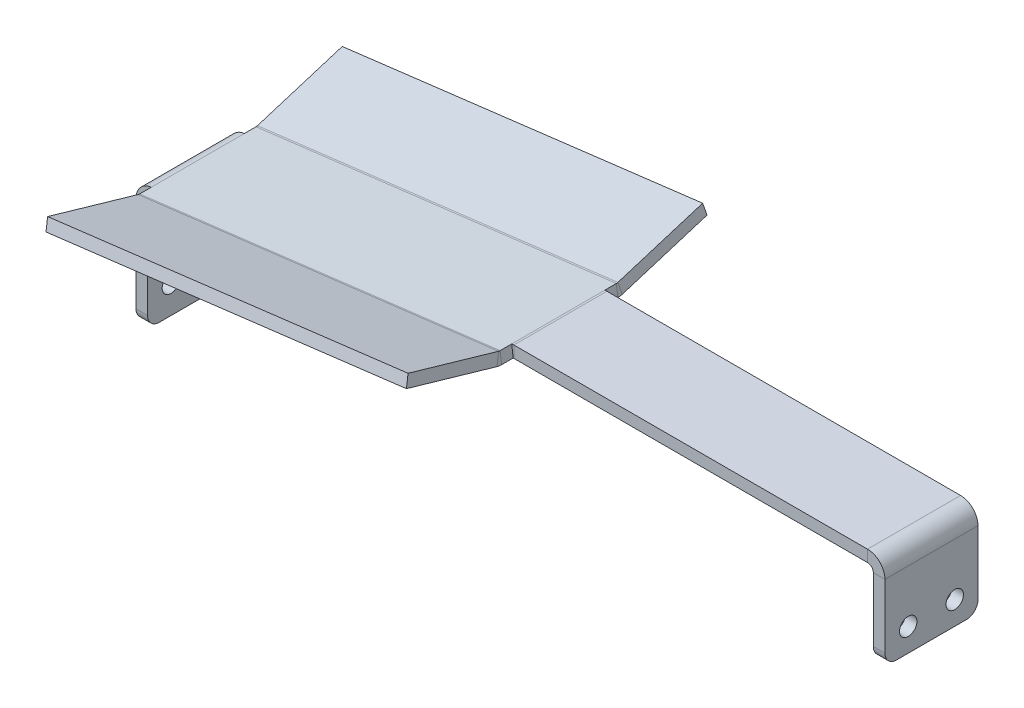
ISO-10303-21;
HEADER;
FILE_DESCRIPTION(('STEP AP214'),'2;1');
FILE_NAME('part.step','',(''),(''),'','','');
FILE_SCHEMA(('AUTOMOTIVE_DESIGN { 1 0 10303 214 1 1 1 1 }'));
ENDSEC;
DATA;
#1=APPLICATION_CONTEXT('core data for automotive mechanical design processes');
#2=APPLICATION_PROTOCOL_DEFINITION('international standard','automotive_design',2000,#1);
#3=PRODUCT_CONTEXT('',#1,'mechanical');
#4=PRODUCT('Part','Part','',(#3));
#5=PRODUCT_RELATED_PRODUCT_CATEGORY('part','',(#4));
#6=PRODUCT_DEFINITION_FORMATION('','',#4);
#7=PRODUCT_DEFINITION_CONTEXT('part definition',#1,'design');
#8=PRODUCT_DEFINITION('design','',#6,#7);
#9=PRODUCT_DEFINITION_SHAPE('','',#8);
#10=(LENGTH_UNIT() NAMED_UNIT(*) SI_UNIT(.MILLI.,.METRE.));
#11=(NAMED_UNIT(*) PLANE_ANGLE_UNIT() SI_UNIT($,.RADIAN.));
#12=(NAMED_UNIT(*) SI_UNIT($,.STERADIAN.) SOLID_ANGLE_UNIT());
#13=UNCERTAINTY_MEASURE_WITH_UNIT(LENGTH_MEASURE(1.E-05),#10,'distance_accuracy_value','');
#14=(GEOMETRIC_REPRESENTATION_CONTEXT(3) GLOBAL_UNCERTAINTY_ASSIGNED_CONTEXT((#13)) GLOBAL_UNIT_ASSIGNED_CONTEXT((#10,
#11,#12)) REPRESENTATION_CONTEXT('',''));
#15=CARTESIAN_POINT('',(0.,0.,0.));
#16=DIRECTION('',(0.,0.,1.));
#17=DIRECTION('',(1.,0.,0.));
#18=AXIS2_PLACEMENT_3D('',#15,#16,#17);
#19=CARTESIAN_POINT('',(0.,20.6375,25.4));
#20=DIRECTION('',(0.,0.,1.));
#21=DIRECTION('',(1.,0.,0.));
#22=AXIS2_PLACEMENT_3D('',#19,#20,#21);
#23=PLANE('',#22);
#24=DIRECTION('',(-1.,0.,0.));
#25=VECTOR('',#24,1.);
#26=CARTESIAN_POINT('',(0.,20.6375,25.4));
#27=LINE('',#26,#25);
#28=CARTESIAN_POINT('',(0.,20.6375,25.4));
#29=VERTEX_POINT('',#28);
#30=CARTESIAN_POINT('',(-3.175,20.6375,25.4));
#31=VERTEX_POINT('',#30);
#32=EDGE_CURVE('E598',#29,#31,#27,.T.);
#33=ORIENTED_EDGE('',*,*,#32,.F.);
#34=CARTESIAN_POINT('',(-4.7625,20.6375,25.4));
#35=DIRECTION('',(0.,0.,-1.));
#36=DIRECTION('',(-1.,0.,0.));
#37=AXIS2_PLACEMENT_3D('',#34,#35,#36);
#38=CIRCLE('',#37,4.7625);
#39=CARTESIAN_POINT('',(-4.7625,25.4,25.4));
#40=VERTEX_POINT('',#39);
#41=EDGE_CURVE('E482',#29,#40,#38,.F.);
#42=ORIENTED_EDGE('',*,*,#41,.T.);
#43=DIRECTION('',(0.,1.,0.));
#44=VECTOR('',#43,1.);
#45=CARTESIAN_POINT('',(-4.7625,22.225,25.4));
#46=LINE('',#45,#44);
#47=CARTESIAN_POINT('',(-4.7625,22.225,25.4));
#48=VERTEX_POINT('',#47);
#49=EDGE_CURVE('E596',#48,#40,#46,.T.);
#50=ORIENTED_EDGE('',*,*,#49,.F.);
#51=CARTESIAN_POINT('',(-4.7625,20.6375,25.4));
#52=DIRECTION('',(0.,0.,1.));
#53=DIRECTION('',(1.,0.,0.));
#54=AXIS2_PLACEMENT_3D('',#51,#52,#53);
#55=CIRCLE('',#54,1.5875);
#56=EDGE_CURVE('E475',#31,#48,#55,.T.);
#57=ORIENTED_EDGE('',*,*,#56,.F.);
#58=EDGE_LOOP('',(#33,#42,#50,#57));
#59=FACE_BOUND('',#58,.T.);
#60=ADVANCED_FACE('F81',(#59),#23,.T.);
#61=CARTESIAN_POINT('',(-4.7625,22.225,25.4));
#62=DIRECTION('',(0.,0.,1.));
#63=DIRECTION('',(1.,0.,0.));
#64=AXIS2_PLACEMENT_3D('',#61,#62,#63);
#65=PLANE('',#64);
#66=DIRECTION('',(0.,1.,0.));
#67=VECTOR('',#66,1.);
#68=CARTESIAN_POINT('',(-3.175,0.,25.4));
#69=LINE('',#68,#67);
#70=CARTESIAN_POINT('',(-3.175,3.175,25.4));
#71=VERTEX_POINT('',#70);
#72=EDGE_CURVE('E478',#71,#31,#69,.T.);
#73=ORIENTED_EDGE('',*,*,#72,.F.);
#74=DIRECTION('',(-1.,0.,0.));
#75=VECTOR('',#74,1.);
#76=CARTESIAN_POINT('',(-4.7625,3.175,25.4));
#77=LINE('',#76,#75);
#78=CARTESIAN_POINT('',(0.,3.175,25.4));
#79=VERTEX_POINT('',#78);
#80=EDGE_CURVE('E617',#71,#79,#77,.F.);
#81=ORIENTED_EDGE('',*,*,#80,.T.);
#82=DIRECTION('',(0.,1.,0.));
#83=VECTOR('',#82,1.);
#84=CARTESIAN_POINT('',(0.,0.,25.4));
#85=LINE('',#84,#83);
#86=EDGE_CURVE('E480',#79,#29,#85,.T.);
#87=ORIENTED_EDGE('',*,*,#86,.T.);
#88=ORIENTED_EDGE('',*,*,#32,.T.);
#89=EDGE_LOOP('',(#73,#81,#87,#88));
#90=FACE_BOUND('',#89,.T.);
#91=ADVANCED_FACE('F668',(#90),#65,.T.);
#92=CARTESIAN_POINT('',(-4.7625,25.4,0.));
#93=DIRECTION('',(0.,0.,-1.));
#94=DIRECTION('',(-1.,0.,0.));
#95=AXIS2_PLACEMENT_3D('',#92,#93,#94);
#96=PLANE('',#95);
#97=DIRECTION('',(0.,-1.,0.));
#98=VECTOR('',#97,1.);
#99=CARTESIAN_POINT('',(-4.7625,25.4,0.));
#100=LINE('',#99,#98);
#101=CARTESIAN_POINT('',(-4.7625,25.4,0.));
#102=VERTEX_POINT('',#101);
#103=CARTESIAN_POINT('',(-4.7625,22.225,0.));
#104=VERTEX_POINT('',#103);
#105=EDGE_CURVE('E594',#102,#104,#100,.T.);
#106=ORIENTED_EDGE('',*,*,#105,.F.);
#107=CARTESIAN_POINT('',(-4.7625,20.6375,0.));
#108=DIRECTION('',(0.,0.,-1.));
#109=DIRECTION('',(-1.,0.,0.));
#110=AXIS2_PLACEMENT_3D('',#107,#108,#109);
#111=CIRCLE('',#110,4.7625);
#112=CARTESIAN_POINT('',(0.,20.6375,0.));
#113=VERTEX_POINT('',#112);
#114=EDGE_CURVE('E515',#113,#102,#111,.F.);
#115=ORIENTED_EDGE('',*,*,#114,.F.);
#116=DIRECTION('',(1.,0.,0.));
#117=VECTOR('',#116,1.);
#118=CARTESIAN_POINT('',(-3.175,20.6375,0.));
#119=LINE('',#118,#117);
#120=CARTESIAN_POINT('',(-3.175,20.6375,0.));
#121=VERTEX_POINT('',#120);
#122=EDGE_CURVE('E591',#121,#113,#119,.T.);
#123=ORIENTED_EDGE('',*,*,#122,.F.);
#124=CARTESIAN_POINT('',(-4.7625,20.6375,0.));
#125=DIRECTION('',(0.,0.,1.));
#126=DIRECTION('',(1.,0.,0.));
#127=AXIS2_PLACEMENT_3D('',#124,#125,#126);
#128=CIRCLE('',#127,1.5875);
#129=EDGE_CURVE('E508',#121,#104,#128,.T.);
#130=ORIENTED_EDGE('',*,*,#129,.T.);
#131=EDGE_LOOP('',(#106,#115,#123,#130));
#132=FACE_BOUND('',#131,.T.);
#133=ADVANCED_FACE('F674',(#132),#96,.T.);
#134=CARTESIAN_POINT('',(-3.175,20.6375,0.));
#135=DIRECTION('',(0.,0.,-1.));
#136=DIRECTION('',(-1.,0.,0.));
#137=AXIS2_PLACEMENT_3D('',#134,#135,#136);
#138=PLANE('',#137);
#139=DIRECTION('',(-1.,0.,0.));
#140=VECTOR('',#139,1.);
#141=CARTESIAN_POINT('',(0.,25.4,0.));
#142=LINE('',#141,#140);
#143=CARTESIAN_POINT('',(-101.307130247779,25.4,0.));
#144=VERTEX_POINT('',#143);
#145=EDGE_CURVE('E518',#102,#144,#142,.T.);
#146=ORIENTED_EDGE('',*,*,#145,.F.);
#147=ORIENTED_EDGE('',*,*,#105,.T.);
#148=DIRECTION('',(-1.,0.,0.));
#149=VECTOR('',#148,1.);
#150=CARTESIAN_POINT('',(0.,22.225,0.));
#151=LINE('',#150,#149);
#152=CARTESIAN_POINT('',(-101.307130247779,22.225,0.));
#153=VERTEX_POINT('',#152);
#154=EDGE_CURVE('E505',#104,#153,#151,.T.);
#155=ORIENTED_EDGE('',*,*,#154,.T.);
#156=DIRECTION('',(0.,1.,0.));
#157=VECTOR('',#156,1.);
#158=CARTESIAN_POINT('',(-101.307130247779,22.225,0.));
#159=LINE('',#158,#157);
#160=EDGE_CURVE('E581',#153,#144,#159,.T.);
#161=ORIENTED_EDGE('',*,*,#160,.T.);
#162=EDGE_LOOP('',(#146,#147,#155,#161));
#163=FACE_BOUND('',#162,.T.);
#164=ADVANCED_FACE('F717',(#163),#138,.T.);
#165=CARTESIAN_POINT('',(-101.307130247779,25.4,25.4));
#166=DIRECTION('',(0.,0.,1.));
#167=DIRECTION('',(1.,0.,0.));
#168=AXIS2_PLACEMENT_3D('',#165,#166,#167);
#169=PLANE('',#168);
#170=DIRECTION('',(0.,-1.,0.));
#171=VECTOR('',#170,1.);
#172=CARTESIAN_POINT('',(-101.307130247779,25.4,25.4));
#173=LINE('',#172,#171);
#174=CARTESIAN_POINT('',(-101.307130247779,25.4,25.4));
#175=VERTEX_POINT('',#174);
#176=CARTESIAN_POINT('',(-101.307130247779,22.225,25.4));
#177=VERTEX_POINT('',#176);
#178=EDGE_CURVE('E589',#175,#177,#173,.T.);
#179=ORIENTED_EDGE('',*,*,#178,.F.);
#180=CARTESIAN_POINT('',(-101.307130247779,20.6375,25.4));
#181=DIRECTION('',(0.,0.,-1.));
#182=DIRECTION('',(-1.,0.,0.));
#183=AXIS2_PLACEMENT_3D('',#180,#181,#182);
#184=CIRCLE('',#183,4.7625);
#185=CARTESIAN_POINT('',(-101.890663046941,25.3641156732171,25.4));
#186=VERTEX_POINT('',#185);
#187=EDGE_CURVE('E488',#175,#186,#184,.F.);
#188=ORIENTED_EDGE('',*,*,#187,.T.);
#189=DIRECTION('',(-0.122526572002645,0.992465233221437,0.));
#190=VECTOR('',#189,1.);
#191=CARTESIAN_POINT('',(-101.501641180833,22.2130385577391,25.4));
#192=LINE('',#191,#190);
#193=CARTESIAN_POINT('',(-101.501641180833,22.2130385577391,25.4));
#194=VERTEX_POINT('',#193);
#195=EDGE_CURVE('E586',#194,#186,#192,.T.);
#196=ORIENTED_EDGE('',*,*,#195,.F.);
#197=CARTESIAN_POINT('',(-101.307130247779,20.6375,25.4));
#198=DIRECTION('',(0.,0.,1.));
#199=DIRECTION('',(1.,0.,0.));
#200=AXIS2_PLACEMENT_3D('',#197,#198,#199);
#201=CIRCLE('',#200,1.5875);
#202=EDGE_CURVE('E469',#177,#194,#201,.T.);
#203=ORIENTED_EDGE('',*,*,#202,.F.);
#204=EDGE_LOOP('',(#179,#188,#196,#203));
#205=FACE_BOUND('',#204,.T.);
#206=ADVANCED_FACE('F753',(#205),#169,.T.);
#207=CARTESIAN_POINT('',(-101.501641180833,22.2130385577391,25.4));
#208=DIRECTION('',(0.,0.,1.));
#209=DIRECTION('',(1.,0.,0.));
#210=AXIS2_PLACEMENT_3D('',#207,#208,#209);
#211=PLANE('',#210);
#212=DIRECTION('',(-1.,0.,0.));
#213=VECTOR('',#212,1.);
#214=CARTESIAN_POINT('',(0.,25.4,25.4));
#215=LINE('',#214,#213);
#216=EDGE_CURVE('E485',#40,#175,#215,.T.);
#217=ORIENTED_EDGE('',*,*,#216,.T.);
#218=ORIENTED_EDGE('',*,*,#178,.T.);
#219=DIRECTION('',(-1.,0.,0.));
#220=VECTOR('',#219,1.);
#221=CARTESIAN_POINT('',(0.,22.225,25.4));
#222=LINE('',#221,#220);
#223=EDGE_CURVE('E472',#48,#177,#222,.T.);
#224=ORIENTED_EDGE('',*,*,#223,.F.);
#225=ORIENTED_EDGE('',*,*,#49,.T.);
#226=EDGE_LOOP('',(#217,#218,#224,#225));
#227=FACE_BOUND('',#226,.T.);
#228=ADVANCED_FACE('F757',(#227),#211,.T.);
#229=CARTESIAN_POINT('',(-101.890663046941,25.3641156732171,0.));
#230=DIRECTION('',(0.,0.,-1.));
#231=DIRECTION('',(-1.,0.,0.));
#232=AXIS2_PLACEMENT_3D('',#229,#230,#231);
#233=PLANE('',#232);
#234=DIRECTION('',(0.122526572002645,-0.992465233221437,0.));
#235=VECTOR('',#234,1.);
#236=CARTESIAN_POINT('',(-101.890663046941,25.3641156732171,0.));
#237=LINE('',#236,#235);
#238=CARTESIAN_POINT('',(-101.890663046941,25.3641156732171,0.));
#239=VERTEX_POINT('',#238);
#240=CARTESIAN_POINT('',(-101.501641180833,22.2130385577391,0.));
#241=VERTEX_POINT('',#240);
#242=EDGE_CURVE('E583',#239,#241,#237,.T.);
#243=ORIENTED_EDGE('',*,*,#242,.F.);
#244=CARTESIAN_POINT('',(-101.307130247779,20.6375,0.));
#245=DIRECTION('',(0.,0.,-1.));
#246=DIRECTION('',(-1.,0.,0.));
#247=AXIS2_PLACEMENT_3D('',#244,#245,#246);
#248=CIRCLE('',#247,4.7625);
#249=EDGE_CURVE('E521',#144,#239,#248,.F.);
#250=ORIENTED_EDGE('',*,*,#249,.F.);
#251=ORIENTED_EDGE('',*,*,#160,.F.);
#252=CARTESIAN_POINT('',(-101.307130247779,20.6375,0.));
#253=DIRECTION('',(0.,0.,1.));
#254=DIRECTION('',(1.,0.,0.));
#255=AXIS2_PLACEMENT_3D('',#252,#253,#254);
#256=CIRCLE('',#255,1.5875);
#257=EDGE_CURVE('E502',#153,#241,#256,.T.);
#258=ORIENTED_EDGE('',*,*,#257,.T.);
#259=EDGE_LOOP('',(#243,#250,#251,#258));
#260=FACE_BOUND('',#259,.T.);
#261=ADVANCED_FACE('F734',(#260),#233,.T.);
#262=CARTESIAN_POINT('',(-200.291032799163,13.2159218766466,25.4));
#263=DIRECTION('',(0.,0.,1.));
#264=DIRECTION('',(1.,0.,0.));
#265=AXIS2_PLACEMENT_3D('',#262,#263,#264);
#266=PLANE('',#265);
#267=DIRECTION('',(0.122526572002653,-0.992465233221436,0.));
#268=VECTOR('',#267,1.);
#269=CARTESIAN_POINT('',(-200.291032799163,13.2159218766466,25.4));
#270=LINE('',#269,#268);
#271=CARTESIAN_POINT('',(-200.291032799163,13.2159218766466,25.4));
#272=VERTEX_POINT('',#271);
#273=CARTESIAN_POINT('',(-199.902010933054,10.0648447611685,25.4));
#274=VERTEX_POINT('',#273);
#275=EDGE_CURVE('E578',#272,#274,#270,.T.);
#276=ORIENTED_EDGE('',*,*,#275,.F.);
#277=CARTESIAN_POINT('',(-199.7075,8.48930620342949,25.4));
#278=DIRECTION('',(0.,0.,-1.));
#279=DIRECTION('',(-1.,0.,0.));
#280=AXIS2_PLACEMENT_3D('',#277,#278,#279);
#281=CIRCLE('',#280,4.7625);
#282=CARTESIAN_POINT('',(-204.47,8.48930620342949,25.4));
#283=VERTEX_POINT('',#282);
#284=EDGE_CURVE('E491',#272,#283,#281,.F.);
#285=ORIENTED_EDGE('',*,*,#284,.T.);
#286=DIRECTION('',(-1.,0.,0.));
#287=VECTOR('',#286,1.);
#288=CARTESIAN_POINT('',(-201.295,8.48930620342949,25.4));
#289=LINE('',#288,#287);
#290=CARTESIAN_POINT('',(-201.295,8.48930620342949,25.4));
#291=VERTEX_POINT('',#290);
#292=EDGE_CURVE('E576',#291,#283,#289,.T.);
#293=ORIENTED_EDGE('',*,*,#292,.F.);
#294=CARTESIAN_POINT('',(-199.7075,8.48930620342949,25.4));
#295=DIRECTION('',(0.,0.,1.));
#296=DIRECTION('',(1.,0.,0.));
#297=AXIS2_PLACEMENT_3D('',#294,#295,#296);
#298=CIRCLE('',#297,1.5875);
#299=EDGE_CURVE('E466',#274,#291,#298,.T.);
#300=ORIENTED_EDGE('',*,*,#299,.F.);
#301=EDGE_LOOP('',(#276,#285,#293,#300));
#302=FACE_BOUND('',#301,.T.);
#303=ADVANCED_FACE('F648',(#302),#266,.T.);
#304=CARTESIAN_POINT('',(-204.47,8.48930620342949,0.));
#305=DIRECTION('',(0.,0.,-1.));
#306=DIRECTION('',(-1.,0.,0.));
#307=AXIS2_PLACEMENT_3D('',#304,#305,#306);
#308=PLANE('',#307);
#309=DIRECTION('',(1.,0.,0.));
#310=VECTOR('',#309,1.);
#311=CARTESIAN_POINT('',(-204.47,8.48930620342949,0.));
#312=LINE('',#311,#310);
#313=CARTESIAN_POINT('',(-204.47,8.48930620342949,0.));
#314=VERTEX_POINT('',#313);
#315=CARTESIAN_POINT('',(-201.295,8.48930620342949,0.));
#316=VERTEX_POINT('',#315);
#317=EDGE_CURVE('E574',#314,#316,#312,.T.);
#318=ORIENTED_EDGE('',*,*,#317,.F.);
#319=CARTESIAN_POINT('',(-199.7075,8.48930620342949,0.));
#320=DIRECTION('',(0.,0.,-1.));
#321=DIRECTION('',(-1.,0.,0.));
#322=AXIS2_PLACEMENT_3D('',#319,#320,#321);
#323=CIRCLE('',#322,4.7625);
#324=CARTESIAN_POINT('',(-200.291032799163,13.2159218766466,0.));
#325=VERTEX_POINT('',#324);
#326=EDGE_CURVE('E464',#325,#314,#323,.F.);
#327=ORIENTED_EDGE('',*,*,#326,.F.);
#328=DIRECTION('',(-0.122526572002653,0.992465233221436,0.));
#329=VECTOR('',#328,1.);
#330=CARTESIAN_POINT('',(-199.902010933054,10.0648447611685,0.));
#331=LINE('',#330,#329);
#332=CARTESIAN_POINT('',(-199.902010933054,10.0648447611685,0.));
#333=VERTEX_POINT('',#332);
#334=EDGE_CURVE('E571',#333,#325,#331,.T.);
#335=ORIENTED_EDGE('',*,*,#334,.F.);
#336=CARTESIAN_POINT('',(-199.7075,8.48930620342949,0.));
#337=DIRECTION('',(0.,0.,1.));
#338=DIRECTION('',(1.,0.,0.));
#339=AXIS2_PLACEMENT_3D('',#336,#337,#338);
#340=CIRCLE('',#339,1.5875);
#341=EDGE_CURVE('E499',#333,#316,#340,.T.);
#342=ORIENTED_EDGE('',*,*,#341,.T.);
#343=EDGE_LOOP('',(#318,#327,#335,#342));
#344=FACE_BOUND('',#343,.T.);
#345=ADVANCED_FACE('F801',(#344),#308,.T.);
#346=CARTESIAN_POINT('',(-199.902010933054,10.0648447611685,0.));
#347=DIRECTION('',(0.,0.,-1.));
#348=DIRECTION('',(-1.,0.,0.));
#349=AXIS2_PLACEMENT_3D('',#346,#347,#348);
#350=PLANE('',#349);
#351=DIRECTION('',(0.,1.,0.));
#352=VECTOR('',#351,1.);
#353=CARTESIAN_POINT('',(-201.295,12.7,0.));
#354=LINE('',#353,#352);
#355=CARTESIAN_POINT('',(-201.295,-17.653,0.));
#356=VERTEX_POINT('',#355);
#357=EDGE_CURVE('E497',#316,#356,#354,.F.);
#358=ORIENTED_EDGE('',*,*,#357,.T.);
#359=DIRECTION('',(-1.,0.,0.));
#360=VECTOR('',#359,1.);
#361=CARTESIAN_POINT('',(-199.902010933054,-17.653,0.));
#362=LINE('',#361,#360);
#363=CARTESIAN_POINT('',(-204.47,-17.653,0.));
#364=VERTEX_POINT('',#363);
#365=EDGE_CURVE('E13',#356,#364,#362,.T.);
#366=ORIENTED_EDGE('',*,*,#365,.T.);
#367=DIRECTION('',(0.,-1.,0.));
#368=VECTOR('',#367,1.);
#369=CARTESIAN_POINT('',(-204.47,12.7,0.));
#370=LINE('',#369,#368);
#371=EDGE_CURVE('E458',#314,#364,#370,.T.);
#372=ORIENTED_EDGE('',*,*,#371,.F.);
#373=ORIENTED_EDGE('',*,*,#317,.T.);
#374=EDGE_LOOP('',(#358,#366,#372,#373));
#375=FACE_BOUND('',#374,.T.);
#376=ADVANCED_FACE('F654',(#375),#350,.T.);
#377=CARTESIAN_POINT('',(-204.47,12.7,25.4));
#378=DIRECTION('',(1.,0.,0.));
#379=DIRECTION('',(0.,0.,-1.));
#380=AXIS2_PLACEMENT_3D('',#377,#378,#379);
#381=PLANE('',#380);
#382=CARTESIAN_POINT('',(-204.47,-13.208,19.05));
#383=DIRECTION('',(-1.,0.,0.));
#384=DIRECTION('',(0.,0.,1.));
#385=AXIS2_PLACEMENT_3D('',#382,#383,#384);
#386=CIRCLE('',#385,2.38125);
#387=CARTESIAN_POINT('',(-204.47,-13.208,21.43125));
#388=VERTEX_POINT('',#387);
#389=EDGE_CURVE('E434',#388,#388,#386,.T.);
#390=ORIENTED_EDGE('',*,*,#389,.F.);
#391=EDGE_LOOP('',(#390));
#392=FACE_BOUND('',#391,.T.);
#393=CARTESIAN_POINT('',(-204.47,-13.208,6.35));
#394=DIRECTION('',(-1.,0.,0.));
#395=DIRECTION('',(0.,0.,1.));
#396=AXIS2_PLACEMENT_3D('',#393,#394,#395);
#397=CIRCLE('',#396,2.38125);
#398=CARTESIAN_POINT('',(-204.47,-13.208,8.73125));
#399=VERTEX_POINT('',#398);
#400=EDGE_CURVE('E440',#399,#399,#397,.T.);
#401=ORIENTED_EDGE('',*,*,#400,.F.);
#402=EDGE_LOOP('',(#401));
#403=FACE_BOUND('',#402,.T.);
#404=DIRECTION('',(0.,0.,-1.));
#405=VECTOR('',#404,1.);
#406=CARTESIAN_POINT('',(-204.47,-20.828,25.4));
#407=LINE('',#406,#405);
#408=CARTESIAN_POINT('',(-204.47,-20.828,22.225));
#409=VERTEX_POINT('',#408);
#410=CARTESIAN_POINT('',(-204.47,-20.828,3.175));
#411=VERTEX_POINT('',#410);
#412=EDGE_CURVE('E568',#409,#411,#407,.T.);
#413=ORIENTED_EDGE('',*,*,#412,.F.);
#414=CARTESIAN_POINT('',(-204.47,-17.653,22.225));
#415=DIRECTION('',(1.,0.,0.));
#416=DIRECTION('',(0.,0.,-1.));
#417=AXIS2_PLACEMENT_3D('',#414,#415,#416);
#418=CIRCLE('',#417,3.175);
#419=CARTESIAN_POINT('',(-204.47,-17.653,25.4));
#420=VERTEX_POINT('',#419);
#421=EDGE_CURVE('E626',#409,#420,#418,.F.);
#422=ORIENTED_EDGE('',*,*,#421,.T.);
#423=DIRECTION('',(0.,-1.,0.));
#424=VECTOR('',#423,1.);
#425=CARTESIAN_POINT('',(-204.47,12.7,25.4));
#426=LINE('',#425,#424);
#427=EDGE_CURVE('E461',#283,#420,#426,.T.);
#428=ORIENTED_EDGE('',*,*,#427,.F.);
#429=DIRECTION('',(0.,0.,-1.));
#430=VECTOR('',#429,1.);
#431=CARTESIAN_POINT('',(-204.47,8.48930620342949,25.4));
#432=LINE('',#431,#430);
#433=EDGE_CURVE('E494',#283,#314,#432,.T.);
#434=ORIENTED_EDGE('',*,*,#433,.T.);
#435=ORIENTED_EDGE('',*,*,#371,.T.);
#436=CARTESIAN_POINT('',(-204.47,-17.653,3.175));
#437=DIRECTION('',(1.,0.,0.));
#438=DIRECTION('',(0.,0.,-1.));
#439=AXIS2_PLACEMENT_3D('',#436,#437,#438);
#440=CIRCLE('',#439,3.175);
#441=EDGE_CURVE('E624',#364,#411,#440,.F.);
#442=ORIENTED_EDGE('',*,*,#441,.T.);
#443=EDGE_LOOP('',(#413,#422,#428,#434,#435,#442));
#444=FACE_BOUND('',#443,.T.);
#445=ADVANCED_FACE('F642',(#392,#403,#444),#381,.F.);
#446=CARTESIAN_POINT('',(-201.295,-20.828,25.4));
#447=DIRECTION('',(0.,-1.,0.));
#448=DIRECTION('',(1.,0.,0.));
#449=AXIS2_PLACEMENT_3D('',#446,#447,#448);
#450=PLANE('',#449);
#451=DIRECTION('',(0.,0.,-1.));
#452=VECTOR('',#451,1.);
#453=CARTESIAN_POINT('',(-201.295,-20.828,25.4));
#454=LINE('',#453,#452);
#455=CARTESIAN_POINT('',(-201.295,-20.828,22.225));
#456=VERTEX_POINT('',#455);
#457=CARTESIAN_POINT('',(-201.295,-20.828,3.175));
#458=VERTEX_POINT('',#457);
#459=EDGE_CURVE('E566',#456,#458,#454,.T.);
#460=ORIENTED_EDGE('',*,*,#459,.F.);
#461=DIRECTION('',(-1.,0.,0.));
#462=VECTOR('',#461,1.);
#463=CARTESIAN_POINT('',(-201.295,-20.828,22.225));
#464=LINE('',#463,#462);
#465=EDGE_CURVE('E621',#456,#409,#464,.T.);
#466=ORIENTED_EDGE('',*,*,#465,.T.);
#467=ORIENTED_EDGE('',*,*,#412,.T.);
#468=DIRECTION('',(-1.,0.,0.));
#469=VECTOR('',#468,1.);
#470=CARTESIAN_POINT('',(-201.295,-20.828,3.175));
#471=LINE('',#470,#469);
#472=EDGE_CURVE('E619',#411,#458,#471,.F.);
#473=ORIENTED_EDGE('',*,*,#472,.T.);
#474=EDGE_LOOP('',(#460,#466,#467,#473));
#475=FACE_BOUND('',#474,.T.);
#476=ADVANCED_FACE('F636',(#475),#450,.T.);
#477=CARTESIAN_POINT('',(-201.295,12.7,25.4));
#478=DIRECTION('',(1.,0.,0.));
#479=DIRECTION('',(0.,0.,-1.));
#480=AXIS2_PLACEMENT_3D('',#477,#478,#479);
#481=PLANE('',#480);
#482=CARTESIAN_POINT('',(-201.295,-13.208,19.05));
#483=DIRECTION('',(-1.,0.,0.));
#484=DIRECTION('',(0.,0.,1.));
#485=AXIS2_PLACEMENT_3D('',#482,#483,#484);
#486=CIRCLE('',#485,2.38125);
#487=CARTESIAN_POINT('',(-201.295,-13.208,21.43125));
#488=VERTEX_POINT('',#487);
#489=EDGE_CURVE('E437',#488,#488,#486,.T.);
#490=ORIENTED_EDGE('',*,*,#489,.T.);
#491=EDGE_LOOP('',(#490));
#492=FACE_BOUND('',#491,.T.);
#493=CARTESIAN_POINT('',(-201.295,-13.208,6.35));
#494=DIRECTION('',(-1.,0.,0.));
#495=DIRECTION('',(0.,0.,1.));
#496=AXIS2_PLACEMENT_3D('',#493,#494,#495);
#497=CIRCLE('',#496,2.38125);
#498=CARTESIAN_POINT('',(-201.295,-13.208,8.73125));
#499=VERTEX_POINT('',#498);
#500=EDGE_CURVE('E443',#499,#499,#497,.T.);
#501=ORIENTED_EDGE('',*,*,#500,.T.);
#502=EDGE_LOOP('',(#501));
#503=FACE_BOUND('',#502,.T.);
#504=DIRECTION('',(0.,1.,0.));
#505=VECTOR('',#504,1.);
#506=CARTESIAN_POINT('',(-201.295,12.7,25.4));
#507=LINE('',#506,#505);
#508=CARTESIAN_POINT('',(-201.295,-17.653,25.4));
#509=VERTEX_POINT('',#508);
#510=EDGE_CURVE('E463',#291,#509,#507,.F.);
#511=ORIENTED_EDGE('',*,*,#510,.T.);
#512=CARTESIAN_POINT('',(-201.295,-17.653,22.225));
#513=DIRECTION('',(1.,0.,0.));
#514=DIRECTION('',(0.,0.,-1.));
#515=AXIS2_PLACEMENT_3D('',#512,#513,#514);
#516=CIRCLE('',#515,3.175);
#517=EDGE_CURVE('E89',#509,#456,#516,.T.);
#518=ORIENTED_EDGE('',*,*,#517,.T.);
#519=ORIENTED_EDGE('',*,*,#459,.T.);
#520=CARTESIAN_POINT('',(-201.295,-17.653,3.175));
#521=DIRECTION('',(1.,0.,0.));
#522=DIRECTION('',(0.,0.,-1.));
#523=AXIS2_PLACEMENT_3D('',#520,#521,#522);
#524=CIRCLE('',#523,3.175);
#525=EDGE_CURVE('E96',#458,#356,#524,.T.);
#526=ORIENTED_EDGE('',*,*,#525,.T.);
#527=ORIENTED_EDGE('',*,*,#357,.F.);
#528=DIRECTION('',(0.,0.,-1.));
#529=VECTOR('',#528,1.);
#530=CARTESIAN_POINT('',(-201.295,8.48930620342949,25.4));
#531=LINE('',#530,#529);
#532=EDGE_CURVE('E563',#291,#316,#531,.T.);
#533=ORIENTED_EDGE('',*,*,#532,.F.);
#534=EDGE_LOOP('',(#511,#518,#519,#526,#527,#533));
#535=FACE_BOUND('',#534,.T.);
#536=ADVANCED_FACE('F631',(#492,#503,#535),#481,.T.);
#537=CARTESIAN_POINT('',(-199.7075,8.48930620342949,25.4));
#538=DIRECTION('',(0.,0.,-1.));
#539=DIRECTION('',(-1.,0.,0.));
#540=AXIS2_PLACEMENT_3D('',#537,#538,#539);
#541=CYLINDRICAL_SURFACE('',#540,1.5875);
#542=ORIENTED_EDGE('',*,*,#341,.F.);
#543=DIRECTION('',(0.,0.,-1.));
#544=VECTOR('',#543,1.);
#545=CARTESIAN_POINT('',(-199.902010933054,10.0648447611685,25.4));
#546=LINE('',#545,#544);
#547=EDGE_CURVE('E560',#274,#333,#546,.T.);
#548=ORIENTED_EDGE('',*,*,#547,.F.);
#549=ORIENTED_EDGE('',*,*,#299,.T.);
#550=ORIENTED_EDGE('',*,*,#532,.T.);
#551=EDGE_LOOP('',(#542,#548,#549,#550));
#552=FACE_BOUND('',#551,.T.);
#553=ADVANCED_FACE('F787',(#552),#541,.F.);
#554=CARTESIAN_POINT('',(-101.210978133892,22.2489228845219,25.4));
#555=DIRECTION('',(0.122526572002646,-0.992465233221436,0.));
#556=DIRECTION('',(0.992465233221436,0.122526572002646,0.));
#557=AXIS2_PLACEMENT_3D('',#554,#555,#556);
#558=PLANE('',#557);
#559=ORIENTED_EDGE('',*,*,#547,.T.);
#560=DIRECTION('',(0.,0.,1.));
#561=VECTOR('',#560,1.);
#562=CARTESIAN_POINT('',(-199.902010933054,10.0648447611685,-3.175));
#563=LINE('',#562,#561);
#564=CARTESIAN_POINT('',(-199.902010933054,10.0648447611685,-3.175));
#565=VERTEX_POINT('',#564);
#566=EDGE_CURVE('E428',#565,#333,#563,.T.);
#567=ORIENTED_EDGE('',*,*,#566,.F.);
#568=DIRECTION('',(-0.992465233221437,-0.122526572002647,0.));
#569=VECTOR('',#568,1.);
#570=CARTESIAN_POINT('',(-199.902010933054,10.0648447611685,-3.175));
#571=LINE('',#570,#569);
#572=CARTESIAN_POINT('',(-101.501641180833,22.2130385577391,-3.175));
#573=VERTEX_POINT('',#572);
#574=EDGE_CURVE('E390',#565,#573,#571,.F.);
#575=ORIENTED_EDGE('',*,*,#574,.T.);
#576=DIRECTION('',(0.,0.,1.));
#577=VECTOR('',#576,1.);
#578=CARTESIAN_POINT('',(-101.501641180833,22.2130385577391,-3.175));
#579=LINE('',#578,#577);
#580=EDGE_CURVE('E425',#573,#241,#579,.T.);
#581=ORIENTED_EDGE('',*,*,#580,.T.);
#582=DIRECTION('',(0.,0.,-1.));
#583=VECTOR('',#582,1.);
#584=CARTESIAN_POINT('',(-101.501641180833,22.2130385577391,25.4));
#585=LINE('',#584,#583);
#586=EDGE_CURVE('E558',#194,#241,#585,.T.);
#587=ORIENTED_EDGE('',*,*,#586,.F.);
#588=DIRECTION('',(0.,0.,-1.));
#589=VECTOR('',#588,1.);
#590=CARTESIAN_POINT('',(-101.501641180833,22.213038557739,28.575));
#591=LINE('',#590,#589);
#592=CARTESIAN_POINT('',(-101.501641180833,22.213038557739,28.575));
#593=VERTEX_POINT('',#592);
#594=EDGE_CURVE('E416',#593,#194,#591,.T.);
#595=ORIENTED_EDGE('',*,*,#594,.F.);
#596=DIRECTION('',(0.992465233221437,0.122526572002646,0.));
#597=VECTOR('',#596,1.);
#598=CARTESIAN_POINT('',(-101.501641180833,22.213038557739,28.575));
#599=LINE('',#598,#597);
#600=CARTESIAN_POINT('',(-199.902010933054,10.0648447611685,28.575));
#601=VERTEX_POINT('',#600);
#602=EDGE_CURVE('E336',#593,#601,#599,.F.);
#603=ORIENTED_EDGE('',*,*,#602,.T.);
#604=DIRECTION('',(0.,0.,-1.));
#605=VECTOR('',#604,1.);
#606=CARTESIAN_POINT('',(-199.902010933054,10.0648447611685,28.575));
#607=LINE('',#606,#605);
#608=EDGE_CURVE('E413',#601,#274,#607,.T.);
#609=ORIENTED_EDGE('',*,*,#608,.T.);
#610=EDGE_LOOP('',(#559,#567,#575,#581,#587,#595,#603,#609));
#611=FACE_BOUND('',#610,.T.);
#612=ADVANCED_FACE('F738',(#611),#558,.T.);
#613=CARTESIAN_POINT('',(-101.307130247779,20.6375,25.4));
#614=DIRECTION('',(0.,0.,-1.));
#615=DIRECTION('',(-1.,0.,0.));
#616=AXIS2_PLACEMENT_3D('',#613,#614,#615);
#617=CYLINDRICAL_SURFACE('',#616,1.5875);
#618=ORIENTED_EDGE('',*,*,#257,.F.);
#619=DIRECTION('',(0.,0.,-1.));
#620=VECTOR('',#619,1.);
#621=CARTESIAN_POINT('',(-101.307130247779,22.225,25.4));
#622=LINE('',#621,#620);
#623=EDGE_CURVE('E555',#177,#153,#622,.T.);
#624=ORIENTED_EDGE('',*,*,#623,.F.);
#625=ORIENTED_EDGE('',*,*,#202,.T.);
#626=ORIENTED_EDGE('',*,*,#586,.T.);
#627=EDGE_LOOP('',(#618,#624,#625,#626));
#628=FACE_BOUND('',#627,.T.);
#629=ADVANCED_FACE('F731',(#628),#617,.F.);
#630=CARTESIAN_POINT('',(0.,22.225,25.4));
#631=DIRECTION('',(0.,-1.,0.));
#632=DIRECTION('',(1.,0.,0.));
#633=AXIS2_PLACEMENT_3D('',#630,#631,#632);
#634=PLANE('',#633);
#635=ORIENTED_EDGE('',*,*,#154,.F.);
#636=DIRECTION('',(0.,0.,-1.));
#637=VECTOR('',#636,1.);
#638=CARTESIAN_POINT('',(-4.7625,22.225,25.4));
#639=LINE('',#638,#637);
#640=EDGE_CURVE('E552',#48,#104,#639,.T.);
#641=ORIENTED_EDGE('',*,*,#640,.F.);
#642=ORIENTED_EDGE('',*,*,#223,.T.);
#643=ORIENTED_EDGE('',*,*,#623,.T.);
#644=EDGE_LOOP('',(#635,#641,#642,#643));
#645=FACE_BOUND('',#644,.T.);
#646=ADVANCED_FACE('F726',(#645),#634,.T.);
#647=CARTESIAN_POINT('',(-4.7625,20.6375,25.4));
#648=DIRECTION('',(0.,0.,-1.));
#649=DIRECTION('',(-1.,0.,0.));
#650=AXIS2_PLACEMENT_3D('',#647,#648,#649);
#651=CYLINDRICAL_SURFACE('',#650,1.5875);
#652=ORIENTED_EDGE('',*,*,#129,.F.);
#653=DIRECTION('',(0.,0.,-1.));
#654=VECTOR('',#653,1.);
#655=CARTESIAN_POINT('',(-3.175,20.6375,25.4));
#656=LINE('',#655,#654);
#657=EDGE_CURVE('E549',#31,#121,#656,.T.);
#658=ORIENTED_EDGE('',*,*,#657,.F.);
#659=ORIENTED_EDGE('',*,*,#56,.T.);
#660=ORIENTED_EDGE('',*,*,#640,.T.);
#661=EDGE_LOOP('',(#652,#658,#659,#660));
#662=FACE_BOUND('',#661,.T.);
#663=ADVANCED_FACE('F721',(#662),#651,.F.);
#664=CARTESIAN_POINT('',(-3.175,0.,25.4));
#665=DIRECTION('',(-1.,0.,0.));
#666=DIRECTION('',(0.,0.,1.));
#667=AXIS2_PLACEMENT_3D('',#664,#665,#666);
#668=PLANE('',#667);
#669=CARTESIAN_POINT('',(-3.175,6.35,6.35));
#670=DIRECTION('',(1.,0.,0.));
#671=DIRECTION('',(0.,0.,-1.));
#672=AXIS2_PLACEMENT_3D('',#669,#670,#671);
#673=CIRCLE('',#672,2.38125);
#674=CARTESIAN_POINT('',(-3.175,6.35,3.96875));
#675=VERTEX_POINT('',#674);
#676=EDGE_CURVE('E449',#675,#675,#673,.T.);
#677=ORIENTED_EDGE('',*,*,#676,.T.);
#678=EDGE_LOOP('',(#677));
#679=FACE_BOUND('',#678,.T.);
#680=CARTESIAN_POINT('',(-3.175,6.35,19.05));
#681=DIRECTION('',(1.,0.,0.));
#682=DIRECTION('',(0.,0.,-1.));
#683=AXIS2_PLACEMENT_3D('',#680,#681,#682);
#684=CIRCLE('',#683,2.38125);
#685=CARTESIAN_POINT('',(-3.175,6.35,16.66875));
#686=VERTEX_POINT('',#685);
#687=EDGE_CURVE('E455',#686,#686,#684,.T.);
#688=ORIENTED_EDGE('',*,*,#687,.T.);
#689=EDGE_LOOP('',(#688));
#690=FACE_BOUND('',#689,.T.);
#691=DIRECTION('',(0.,1.,0.));
#692=VECTOR('',#691,1.);
#693=CARTESIAN_POINT('',(-3.175,0.,0.));
#694=LINE('',#693,#692);
#695=CARTESIAN_POINT('',(-3.175,3.175,0.));
#696=VERTEX_POINT('',#695);
#697=EDGE_CURVE('E511',#696,#121,#694,.T.);
#698=ORIENTED_EDGE('',*,*,#697,.F.);
#699=CARTESIAN_POINT('',(-3.17500000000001,3.175,3.175));
#700=DIRECTION('',(-1.,0.,0.));
#701=DIRECTION('',(0.,0.,1.));
#702=AXIS2_PLACEMENT_3D('',#699,#700,#701);
#703=CIRCLE('',#702,3.175);
#704=CARTESIAN_POINT('',(-3.175,0.,3.175));
#705=VERTEX_POINT('',#704);
#706=EDGE_CURVE('E606',#696,#705,#703,.T.);
#707=ORIENTED_EDGE('',*,*,#706,.T.);
#708=DIRECTION('',(0.,0.,-1.));
#709=VECTOR('',#708,1.);
#710=CARTESIAN_POINT('',(-3.175,0.,25.4));
#711=LINE('',#710,#709);
#712=CARTESIAN_POINT('',(-3.175,0.,22.225));
#713=VERTEX_POINT('',#712);
#714=EDGE_CURVE('E546',#713,#705,#711,.T.);
#715=ORIENTED_EDGE('',*,*,#714,.F.);
#716=CARTESIAN_POINT('',(-3.175,3.175,22.225));
#717=DIRECTION('',(-1.,0.,0.));
#718=DIRECTION('',(0.,0.,1.));
#719=AXIS2_PLACEMENT_3D('',#716,#717,#718);
#720=CIRCLE('',#719,3.175);
#721=EDGE_CURVE('E604',#713,#71,#720,.T.);
#722=ORIENTED_EDGE('',*,*,#721,.T.);
#723=ORIENTED_EDGE('',*,*,#72,.T.);
#724=ORIENTED_EDGE('',*,*,#657,.T.);
#725=EDGE_LOOP('',(#698,#707,#715,#722,#723,#724));
#726=FACE_BOUND('',#725,.T.);
#727=ADVANCED_FACE('F775',(#679,#690,#726),#668,.T.);
#728=CARTESIAN_POINT('',(0.,0.,25.4));
#729=DIRECTION('',(0.,-1.,0.));
#730=DIRECTION('',(0.,0.,-1.));
#731=AXIS2_PLACEMENT_3D('',#728,#729,#730);
#732=PLANE('',#731);
#733=ORIENTED_EDGE('',*,*,#714,.T.);
#734=DIRECTION('',(-1.,0.,0.));
#735=VECTOR('',#734,1.);
#736=CARTESIAN_POINT('',(0.,0.,3.175));
#737=LINE('',#736,#735);
#738=CARTESIAN_POINT('',(0.,0.,3.175));
#739=VERTEX_POINT('',#738);
#740=EDGE_CURVE('E611',#705,#739,#737,.F.);
#741=ORIENTED_EDGE('',*,*,#740,.T.);
#742=DIRECTION('',(0.,0.,-1.));
#743=VECTOR('',#742,1.);
#744=CARTESIAN_POINT('',(0.,0.,25.4));
#745=LINE('',#744,#743);
#746=CARTESIAN_POINT('',(0.,0.,22.225));
#747=VERTEX_POINT('',#746);
#748=EDGE_CURVE('E543',#747,#739,#745,.T.);
#749=ORIENTED_EDGE('',*,*,#748,.F.);
#750=DIRECTION('',(-1.,0.,0.));
#751=VECTOR('',#750,1.);
#752=CARTESIAN_POINT('',(0.,0.,22.225));
#753=LINE('',#752,#751);
#754=EDGE_CURVE('E608',#747,#713,#753,.T.);
#755=ORIENTED_EDGE('',*,*,#754,.T.);
#756=EDGE_LOOP('',(#733,#741,#749,#755));
#757=FACE_BOUND('',#756,.T.);
#758=ADVANCED_FACE('F699',(#757),#732,.T.);
#759=CARTESIAN_POINT('',(0.,0.,25.4));
#760=DIRECTION('',(-1.,0.,0.));
#761=DIRECTION('',(0.,0.,1.));
#762=AXIS2_PLACEMENT_3D('',#759,#760,#761);
#763=PLANE('',#762);
#764=CARTESIAN_POINT('',(0.,6.35,6.35));
#765=DIRECTION('',(1.,0.,0.));
#766=DIRECTION('',(0.,0.,-1.));
#767=AXIS2_PLACEMENT_3D('',#764,#765,#766);
#768=CIRCLE('',#767,2.38125);
#769=CARTESIAN_POINT('',(0.,6.35,3.96875));
#770=VERTEX_POINT('',#769);
#771=EDGE_CURVE('E446',#770,#770,#768,.T.);
#772=ORIENTED_EDGE('',*,*,#771,.F.);
#773=EDGE_LOOP('',(#772));
#774=FACE_BOUND('',#773,.T.);
#775=CARTESIAN_POINT('',(0.,6.35,19.05));
#776=DIRECTION('',(1.,0.,0.));
#777=DIRECTION('',(0.,0.,-1.));
#778=AXIS2_PLACEMENT_3D('',#775,#776,#777);
#779=CIRCLE('',#778,2.38125);
#780=CARTESIAN_POINT('',(0.,6.35,16.66875));
#781=VERTEX_POINT('',#780);
#782=EDGE_CURVE('E452',#781,#781,#779,.T.);
#783=ORIENTED_EDGE('',*,*,#782,.F.);
#784=EDGE_LOOP('',(#783));
#785=FACE_BOUND('',#784,.T.);
#786=ORIENTED_EDGE('',*,*,#748,.T.);
#787=CARTESIAN_POINT('',(0.,3.175,3.175));
#788=DIRECTION('',(-1.,0.,0.));
#789=DIRECTION('',(0.,0.,1.));
#790=AXIS2_PLACEMENT_3D('',#787,#788,#789);
#791=CIRCLE('',#790,3.175);
#792=CARTESIAN_POINT('',(0.,3.175,0.));
#793=VERTEX_POINT('',#792);
#794=EDGE_CURVE('E615',#739,#793,#791,.F.);
#795=ORIENTED_EDGE('',*,*,#794,.T.);
#796=DIRECTION('',(0.,1.,0.));
#797=VECTOR('',#796,1.);
#798=CARTESIAN_POINT('',(0.,0.,0.));
#799=LINE('',#798,#797);
#800=EDGE_CURVE('E513',#793,#113,#799,.T.);
#801=ORIENTED_EDGE('',*,*,#800,.T.);
#802=DIRECTION('',(0.,0.,-1.));
#803=VECTOR('',#802,1.);
#804=CARTESIAN_POINT('',(0.,20.6375,25.4));
#805=LINE('',#804,#803);
#806=EDGE_CURVE('E540',#29,#113,#805,.T.);
#807=ORIENTED_EDGE('',*,*,#806,.F.);
#808=ORIENTED_EDGE('',*,*,#86,.F.);
#809=CARTESIAN_POINT('',(0.,3.175,22.225));
#810=DIRECTION('',(-1.,0.,0.));
#811=DIRECTION('',(0.,0.,1.));
#812=AXIS2_PLACEMENT_3D('',#809,#810,#811);
#813=CIRCLE('',#812,3.175);
#814=EDGE_CURVE('E613',#79,#747,#813,.F.);
#815=ORIENTED_EDGE('',*,*,#814,.T.);
#816=EDGE_LOOP('',(#786,#795,#801,#807,#808,#815));
#817=FACE_BOUND('',#816,.T.);
#818=ADVANCED_FACE('F695',(#774,#785,#817),#763,.F.);
#819=CARTESIAN_POINT('',(-4.7625,20.6375,25.4));
#820=DIRECTION('',(0.,0.,-1.));
#821=DIRECTION('',(-1.,0.,0.));
#822=AXIS2_PLACEMENT_3D('',#819,#820,#821);
#823=CYLINDRICAL_SURFACE('',#822,4.7625);
#824=ORIENTED_EDGE('',*,*,#114,.T.);
#825=DIRECTION('',(0.,0.,-1.));
#826=VECTOR('',#825,1.);
#827=CARTESIAN_POINT('',(-4.7625,25.4,25.4));
#828=LINE('',#827,#826);
#829=EDGE_CURVE('E537',#40,#102,#828,.T.);
#830=ORIENTED_EDGE('',*,*,#829,.F.);
#831=ORIENTED_EDGE('',*,*,#41,.F.);
#832=ORIENTED_EDGE('',*,*,#806,.T.);
#833=EDGE_LOOP('',(#824,#830,#831,#832));
#834=FACE_BOUND('',#833,.T.);
#835=ADVANCED_FACE('F712',(#834),#823,.T.);
#836=CARTESIAN_POINT('',(0.,25.4,25.4));
#837=DIRECTION('',(0.,-1.,0.));
#838=DIRECTION('',(1.,0.,0.));
#839=AXIS2_PLACEMENT_3D('',#836,#837,#838);
#840=PLANE('',#839);
#841=ORIENTED_EDGE('',*,*,#145,.T.);
#842=DIRECTION('',(0.,0.,-1.));
#843=VECTOR('',#842,1.);
#844=CARTESIAN_POINT('',(-101.307130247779,25.4,25.4));
#845=LINE('',#844,#843);
#846=EDGE_CURVE('E534',#175,#144,#845,.T.);
#847=ORIENTED_EDGE('',*,*,#846,.F.);
#848=ORIENTED_EDGE('',*,*,#216,.F.);
#849=ORIENTED_EDGE('',*,*,#829,.T.);
#850=EDGE_LOOP('',(#841,#847,#848,#849));
#851=FACE_BOUND('',#850,.T.);
#852=ADVANCED_FACE('F759',(#851),#840,.F.);
#853=CARTESIAN_POINT('',(-101.307130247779,20.6375,25.4));
#854=DIRECTION('',(0.,0.,-1.));
#855=DIRECTION('',(-1.,0.,0.));
#856=AXIS2_PLACEMENT_3D('',#853,#854,#855);
#857=CYLINDRICAL_SURFACE('',#856,4.7625);
#858=ORIENTED_EDGE('',*,*,#249,.T.);
#859=DIRECTION('',(0.,0.,-1.));
#860=VECTOR('',#859,1.);
#861=CARTESIAN_POINT('',(-101.890663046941,25.3641156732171,25.4));
#862=LINE('',#861,#860);
#863=EDGE_CURVE('E531',#186,#239,#862,.T.);
#864=ORIENTED_EDGE('',*,*,#863,.F.);
#865=ORIENTED_EDGE('',*,*,#187,.F.);
#866=ORIENTED_EDGE('',*,*,#846,.T.);
#867=EDGE_LOOP('',(#858,#864,#865,#866));
#868=FACE_BOUND('',#867,.T.);
#869=ADVANCED_FACE('F751',(#868),#857,.T.);
#870=CARTESIAN_POINT('',(-101.6,25.4,25.4));
#871=DIRECTION('',(0.122526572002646,-0.992465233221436,0.));
#872=DIRECTION('',(0.992465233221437,0.122526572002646,0.));
#873=AXIS2_PLACEMENT_3D('',#870,#871,#872);
#874=PLANE('',#873);
#875=ORIENTED_EDGE('',*,*,#863,.T.);
#876=DIRECTION('',(0.,0.,1.));
#877=VECTOR('',#876,1.);
#878=CARTESIAN_POINT('',(-101.890663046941,25.3641156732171,-3.175));
#879=LINE('',#878,#877);
#880=CARTESIAN_POINT('',(-101.890663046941,25.3641156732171,-3.175));
#881=VERTEX_POINT('',#880);
#882=EDGE_CURVE('E422',#881,#239,#879,.T.);
#883=ORIENTED_EDGE('',*,*,#882,.F.);
#884=DIRECTION('',(-0.992465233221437,-0.122526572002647,0.));
#885=VECTOR('',#884,1.);
#886=CARTESIAN_POINT('',(-200.291032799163,13.2159218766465,-3.175));
#887=LINE('',#886,#885);
#888=CARTESIAN_POINT('',(-200.291032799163,13.2159218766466,-3.175));
#889=VERTEX_POINT('',#888);
#890=EDGE_CURVE('E403',#889,#881,#887,.F.);
#891=ORIENTED_EDGE('',*,*,#890,.F.);
#892=DIRECTION('',(0.,0.,1.));
#893=VECTOR('',#892,1.);
#894=CARTESIAN_POINT('',(-200.291032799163,13.2159218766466,-3.175));
#895=LINE('',#894,#893);
#896=EDGE_CURVE('E431',#889,#325,#895,.T.);
#897=ORIENTED_EDGE('',*,*,#896,.T.);
#898=DIRECTION('',(0.,0.,-1.));
#899=VECTOR('',#898,1.);
#900=CARTESIAN_POINT('',(-200.291032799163,13.2159218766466,25.4));
#901=LINE('',#900,#899);
#902=EDGE_CURVE('E528',#272,#325,#901,.T.);
#903=ORIENTED_EDGE('',*,*,#902,.F.);
#904=DIRECTION('',(0.,0.,-1.));
#905=VECTOR('',#904,1.);
#906=CARTESIAN_POINT('',(-200.291032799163,13.2159218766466,28.575));
#907=LINE('',#906,#905);
#908=CARTESIAN_POINT('',(-200.291032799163,13.2159218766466,28.575));
#909=VERTEX_POINT('',#908);
#910=EDGE_CURVE('E410',#909,#272,#907,.T.);
#911=ORIENTED_EDGE('',*,*,#910,.F.);
#912=DIRECTION('',(0.992465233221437,0.122526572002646,0.));
#913=VECTOR('',#912,1.);
#914=CARTESIAN_POINT('',(-101.890663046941,25.3641156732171,28.575));
#915=LINE('',#914,#913);
#916=CARTESIAN_POINT('',(-101.890663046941,25.3641156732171,28.575));
#917=VERTEX_POINT('',#916);
#918=EDGE_CURVE('E349',#917,#909,#915,.F.);
#919=ORIENTED_EDGE('',*,*,#918,.F.);
#920=DIRECTION('',(0.,0.,-1.));
#921=VECTOR('',#920,1.);
#922=CARTESIAN_POINT('',(-101.890663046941,25.3641156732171,28.575));
#923=LINE('',#922,#921);
#924=EDGE_CURVE('E419',#917,#186,#923,.T.);
#925=ORIENTED_EDGE('',*,*,#924,.T.);
#926=EDGE_LOOP('',(#875,#883,#891,#897,#903,#911,#919,#925));
#927=FACE_BOUND('',#926,.T.);
#928=ADVANCED_FACE('F746',(#927),#874,.F.);
#929=CARTESIAN_POINT('',(-199.7075,8.48930620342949,25.4));
#930=DIRECTION('',(0.,0.,-1.));
#931=DIRECTION('',(-1.,0.,0.));
#932=AXIS2_PLACEMENT_3D('',#929,#930,#931);
#933=CYLINDRICAL_SURFACE('',#932,4.7625);
#934=ORIENTED_EDGE('',*,*,#326,.T.);
#935=ORIENTED_EDGE('',*,*,#433,.F.);
#936=ORIENTED_EDGE('',*,*,#284,.F.);
#937=ORIENTED_EDGE('',*,*,#902,.T.);
#938=EDGE_LOOP('',(#934,#935,#936,#937));
#939=FACE_BOUND('',#938,.T.);
#940=ADVANCED_FACE('F651',(#939),#933,.T.);
#941=CARTESIAN_POINT('',(-199.7075,8.48930620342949,25.4));
#942=DIRECTION('',(0.,0.,1.));
#943=DIRECTION('',(1.,0.,0.));
#944=AXIS2_PLACEMENT_3D('',#941,#942,#943);
#945=PLANE('',#944);
#946=ORIENTED_EDGE('',*,*,#427,.T.);
#947=DIRECTION('',(-1.,0.,0.));
#948=VECTOR('',#947,1.);
#949=CARTESIAN_POINT('',(-199.7075,-17.653,25.4));
#950=LINE('',#949,#948);
#951=EDGE_CURVE('E104',#420,#509,#950,.F.);
#952=ORIENTED_EDGE('',*,*,#951,.T.);
#953=ORIENTED_EDGE('',*,*,#510,.F.);
#954=ORIENTED_EDGE('',*,*,#292,.T.);
#955=EDGE_LOOP('',(#946,#952,#953,#954));
#956=FACE_BOUND('',#955,.T.);
#957=ADVANCED_FACE('F643',(#956),#945,.T.);
#958=CARTESIAN_POINT('',(-199.7075,8.48930620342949,0.));
#959=DIRECTION('',(0.,0.,1.));
#960=DIRECTION('',(1.,0.,0.));
#961=AXIS2_PLACEMENT_3D('',#958,#959,#960);
#962=PLANE('',#961);
#963=ORIENTED_EDGE('',*,*,#800,.F.);
#964=DIRECTION('',(-1.,0.,0.));
#965=VECTOR('',#964,1.);
#966=CARTESIAN_POINT('',(-3.17500000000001,3.175,0.));
#967=LINE('',#966,#965);
#968=EDGE_CURVE('E601',#793,#696,#967,.T.);
#969=ORIENTED_EDGE('',*,*,#968,.T.);
#970=ORIENTED_EDGE('',*,*,#697,.T.);
#971=ORIENTED_EDGE('',*,*,#122,.T.);
#972=EDGE_LOOP('',(#963,#969,#970,#971));
#973=FACE_BOUND('',#972,.T.);
#974=ADVANCED_FACE('F705',(#973),#962,.F.);
#975=CARTESIAN_POINT('',(-3.175,6.35,19.05));
#976=DIRECTION('',(1.,0.,0.));
#977=DIRECTION('',(0.,0.,-1.));
#978=AXIS2_PLACEMENT_3D('',#975,#976,#977);
#979=CYLINDRICAL_SURFACE('',#978,2.38125);
#980=ORIENTED_EDGE('',*,*,#687,.F.);
#981=EDGE_LOOP('',(#980));
#982=FACE_BOUND('',#981,.T.);
#983=ORIENTED_EDGE('',*,*,#782,.T.);
#984=EDGE_LOOP('',(#983));
#985=FACE_BOUND('',#984,.T.);
#986=ADVANCED_FACE('F909',(#982,#985),#979,.F.);
#987=CARTESIAN_POINT('',(-3.175,6.35,6.35));
#988=DIRECTION('',(1.,0.,0.));
#989=DIRECTION('',(0.,0.,-1.));
#990=AXIS2_PLACEMENT_3D('',#987,#988,#989);
#991=CYLINDRICAL_SURFACE('',#990,2.38125);
#992=ORIENTED_EDGE('',*,*,#676,.F.);
#993=EDGE_LOOP('',(#992));
#994=FACE_BOUND('',#993,.T.);
#995=ORIENTED_EDGE('',*,*,#771,.T.);
#996=EDGE_LOOP('',(#995));
#997=FACE_BOUND('',#996,.T.);
#998=ADVANCED_FACE('F914',(#994,#997),#991,.F.);
#999=CARTESIAN_POINT('',(-201.295,-13.208,6.35));
#1000=DIRECTION('',(-1.,0.,0.));
#1001=DIRECTION('',(0.,0.,1.));
#1002=AXIS2_PLACEMENT_3D('',#999,#1000,#1001);
#1003=CYLINDRICAL_SURFACE('',#1002,2.38125);
#1004=ORIENTED_EDGE('',*,*,#500,.F.);
#1005=EDGE_LOOP('',(#1004));
#1006=FACE_BOUND('',#1005,.T.);
#1007=ORIENTED_EDGE('',*,*,#400,.T.);
#1008=EDGE_LOOP('',(#1007));
#1009=FACE_BOUND('',#1008,.T.);
#1010=ADVANCED_FACE('F927',(#1006,#1009),#1003,.F.);
#1011=CARTESIAN_POINT('',(-201.295,-13.208,19.05));
#1012=DIRECTION('',(-1.,0.,0.));
#1013=DIRECTION('',(0.,0.,1.));
#1014=AXIS2_PLACEMENT_3D('',#1011,#1012,#1013);
#1015=CYLINDRICAL_SURFACE('',#1014,2.38125);
#1016=ORIENTED_EDGE('',*,*,#489,.F.);
#1017=EDGE_LOOP('',(#1016));
#1018=FACE_BOUND('',#1017,.T.);
#1019=ORIENTED_EDGE('',*,*,#389,.T.);
#1020=EDGE_LOOP('',(#1019));
#1021=FACE_BOUND('',#1020,.T.);
#1022=ADVANCED_FACE('F683',(#1018,#1021),#1015,.F.);
#1023=CARTESIAN_POINT('',(-199.7075,3.175,3.175));
#1024=DIRECTION('',(1.,0.,0.));
#1025=DIRECTION('',(0.,0.,-1.));
#1026=AXIS2_PLACEMENT_3D('',#1023,#1024,#1025);
#1027=CYLINDRICAL_SURFACE('',#1026,3.175);
#1028=ORIENTED_EDGE('',*,*,#794,.F.);
#1029=ORIENTED_EDGE('',*,*,#740,.F.);
#1030=ORIENTED_EDGE('',*,*,#706,.F.);
#1031=ORIENTED_EDGE('',*,*,#968,.F.);
#1032=EDGE_LOOP('',(#1028,#1029,#1030,#1031));
#1033=FACE_BOUND('',#1032,.T.);
#1034=ADVANCED_FACE('F680',(#1033),#1027,.T.);
#1035=CARTESIAN_POINT('',(0.,3.175,22.225));
#1036=DIRECTION('',(-1.,0.,0.));
#1037=DIRECTION('',(0.,0.,1.));
#1038=AXIS2_PLACEMENT_3D('',#1035,#1036,#1037);
#1039=CYLINDRICAL_SURFACE('',#1038,3.175);
#1040=ORIENTED_EDGE('',*,*,#814,.F.);
#1041=ORIENTED_EDGE('',*,*,#80,.F.);
#1042=ORIENTED_EDGE('',*,*,#721,.F.);
#1043=ORIENTED_EDGE('',*,*,#754,.F.);
#1044=EDGE_LOOP('',(#1040,#1041,#1042,#1043));
#1045=FACE_BOUND('',#1044,.T.);
#1046=ADVANCED_FACE('F666',(#1045),#1039,.T.);
#1047=CARTESIAN_POINT('',(-201.295,-17.653,22.225));
#1048=DIRECTION('',(-1.,0.,0.));
#1049=DIRECTION('',(0.,-1.,0.));
#1050=AXIS2_PLACEMENT_3D('',#1047,#1048,#1049);
#1051=CYLINDRICAL_SURFACE('',#1050,3.175);
#1052=ORIENTED_EDGE('',*,*,#517,.F.);
#1053=ORIENTED_EDGE('',*,*,#951,.F.);
#1054=ORIENTED_EDGE('',*,*,#421,.F.);
#1055=ORIENTED_EDGE('',*,*,#465,.F.);
#1056=EDGE_LOOP('',(#1052,#1053,#1054,#1055));
#1057=FACE_BOUND('',#1056,.T.);
#1058=ADVANCED_FACE('F639',(#1057),#1051,.T.);
#1059=CARTESIAN_POINT('',(-199.902010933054,-17.653,3.175));
#1060=DIRECTION('',(-1.,0.,0.));
#1061=DIRECTION('',(0.,-1.,0.));
#1062=AXIS2_PLACEMENT_3D('',#1059,#1060,#1061);
#1063=CYLINDRICAL_SURFACE('',#1062,3.175);
#1064=ORIENTED_EDGE('',*,*,#525,.F.);
#1065=ORIENTED_EDGE('',*,*,#472,.F.);
#1066=ORIENTED_EDGE('',*,*,#441,.F.);
#1067=ORIENTED_EDGE('',*,*,#365,.F.);
#1068=EDGE_LOOP('',(#1064,#1065,#1066,#1067));
#1069=FACE_BOUND('',#1068,.T.);
#1070=ADVANCED_FACE('F83',(#1069),#1063,.T.);
#1071=CARTESIAN_POINT('',(-200.291032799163,13.2159218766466,-3.175));
#1072=DIRECTION('',(-0.992465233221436,-0.122526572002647,0.));
#1073=DIRECTION('',(0.122526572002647,-0.992465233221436,0.));
#1074=AXIS2_PLACEMENT_3D('',#1071,#1072,#1073);
#1075=PLANE('',#1074);
#1076=ORIENTED_EDGE('',*,*,#896,.F.);
#1077=DIRECTION('',(0.122526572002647,-0.992465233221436,0.));
#1078=VECTOR('',#1077,1.);
#1079=CARTESIAN_POINT('',(-200.291032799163,13.2159218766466,-3.175));
#1080=LINE('',#1079,#1078);
#1081=EDGE_CURVE('E397',#889,#565,#1080,.T.);
#1082=ORIENTED_EDGE('',*,*,#1081,.T.);
#1083=ORIENTED_EDGE('',*,*,#566,.T.);
#1084=ORIENTED_EDGE('',*,*,#334,.T.);
#1085=EDGE_LOOP('',(#1076,#1082,#1083,#1084));
#1086=FACE_BOUND('',#1085,.T.);
#1087=ADVANCED_FACE('F658',(#1086),#1075,.T.);
#1088=CARTESIAN_POINT('',(-101.890663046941,25.3641156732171,-3.175));
#1089=DIRECTION('',(-0.992465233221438,-0.122526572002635,0.));
#1090=DIRECTION('',(0.122526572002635,-0.992465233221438,0.));
#1091=AXIS2_PLACEMENT_3D('',#1088,#1089,#1090);
#1092=PLANE('',#1091);
#1093=ORIENTED_EDGE('',*,*,#580,.F.);
#1094=DIRECTION('',(0.122526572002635,-0.992465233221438,0.));
#1095=VECTOR('',#1094,1.);
#1096=CARTESIAN_POINT('',(-101.890663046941,25.3641156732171,-3.175));
#1097=LINE('',#1096,#1095);
#1098=EDGE_CURVE('E407',#881,#573,#1097,.T.);
#1099=ORIENTED_EDGE('',*,*,#1098,.F.);
#1100=ORIENTED_EDGE('',*,*,#882,.T.);
#1101=ORIENTED_EDGE('',*,*,#242,.T.);
#1102=EDGE_LOOP('',(#1093,#1099,#1100,#1101));
#1103=FACE_BOUND('',#1102,.T.);
#1104=ADVANCED_FACE('F663',(#1103),#1092,.F.);
#1105=CARTESIAN_POINT('',(-101.890663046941,25.3641156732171,28.575));
#1106=DIRECTION('',(0.992465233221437,0.122526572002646,0.));
#1107=DIRECTION('',(0.122526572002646,-0.992465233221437,0.));
#1108=AXIS2_PLACEMENT_3D('',#1105,#1106,#1107);
#1109=PLANE('',#1108);
#1110=ORIENTED_EDGE('',*,*,#924,.F.);
#1111=DIRECTION('',(0.122526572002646,-0.992465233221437,0.));
#1112=VECTOR('',#1111,1.);
#1113=CARTESIAN_POINT('',(-101.890663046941,25.3641156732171,28.575));
#1114=LINE('',#1113,#1112);
#1115=EDGE_CURVE('E343',#917,#593,#1114,.T.);
#1116=ORIENTED_EDGE('',*,*,#1115,.T.);
#1117=ORIENTED_EDGE('',*,*,#594,.T.);
#1118=ORIENTED_EDGE('',*,*,#195,.T.);
#1119=EDGE_LOOP('',(#1110,#1116,#1117,#1118));
#1120=FACE_BOUND('',#1119,.T.);
#1121=ADVANCED_FACE('F1086',(#1120),#1109,.T.);
#1122=CARTESIAN_POINT('',(-200.291032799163,13.2159218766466,28.575));
#1123=DIRECTION('',(0.992465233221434,0.122526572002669,0.));
#1124=DIRECTION('',(0.122526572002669,-0.992465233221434,0.));
#1125=AXIS2_PLACEMENT_3D('',#1122,#1123,#1124);
#1126=PLANE('',#1125);
#1127=ORIENTED_EDGE('',*,*,#608,.F.);
#1128=DIRECTION('',(0.122526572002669,-0.992465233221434,0.));
#1129=VECTOR('',#1128,1.);
#1130=CARTESIAN_POINT('',(-200.291032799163,13.2159218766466,28.575));
#1131=LINE('',#1130,#1129);
#1132=EDGE_CURVE('E354',#909,#601,#1131,.T.);
#1133=ORIENTED_EDGE('',*,*,#1132,.F.);
#1134=ORIENTED_EDGE('',*,*,#910,.T.);
#1135=ORIENTED_EDGE('',*,*,#275,.T.);
#1136=EDGE_LOOP('',(#1127,#1133,#1134,#1135));
#1137=FACE_BOUND('',#1136,.T.);
#1138=ADVANCED_FACE('F1096',(#1137),#1126,.F.);
#1139=CARTESIAN_POINT('',(-102.085173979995,26.9396542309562,-3.175));
#1140=DIRECTION('',(0.992465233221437,0.122526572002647,0.));
#1141=DIRECTION('',(-0.122526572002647,0.992465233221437,0.));
#1142=AXIS2_PLACEMENT_3D('',#1139,#1140,#1141);
#1143=PLANE('',#1142);
#1144=DIRECTION('',(-0.118351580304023,0.958647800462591,0.258819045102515));
#1145=VECTOR('',#1144,1.);
#1146=CARTESIAN_POINT('',(-101.521524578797,22.3740940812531,-4.40762570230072));
#1147=LINE('',#1146,#1145);
#1148=CARTESIAN_POINT('',(-101.897290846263,25.4178008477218,-3.58587523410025));
#1149=VERTEX_POINT('',#1148);
#1150=CARTESIAN_POINT('',(-101.521524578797,22.3740940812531,-4.40762570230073));
#1151=VERTEX_POINT('',#1150);
#1152=EDGE_CURVE('E357',#1149,#1151,#1147,.F.);
#1153=ORIENTED_EDGE('',*,*,#1152,.F.);
#1154=CARTESIAN_POINT('',(-102.085173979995,26.9396542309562,-3.175));
#1155=DIRECTION('',(-0.992465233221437,-0.122526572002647,0.));
#1156=DIRECTION('',(0.122526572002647,-0.992465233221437,0.));
#1157=AXIS2_PLACEMENT_3D('',#1154,#1155,#1156);
#1158=CIRCLE('',#1157,1.58750000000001);
#1159=EDGE_CURVE('E400',#881,#1149,#1158,.F.);
#1160=ORIENTED_EDGE('',*,*,#1159,.F.);
#1161=ORIENTED_EDGE('',*,*,#1098,.T.);
#1162=CARTESIAN_POINT('',(-102.085173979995,26.9396542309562,-3.175));
#1163=DIRECTION('',(-0.992465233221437,-0.122526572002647,0.));
#1164=DIRECTION('',(0.122526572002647,-0.992465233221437,0.));
#1165=AXIS2_PLACEMENT_3D('',#1162,#1163,#1164);
#1166=CIRCLE('',#1165,4.76250000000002);
#1167=EDGE_CURVE('E393',#573,#1151,#1166,.F.);
#1168=ORIENTED_EDGE('',*,*,#1167,.T.);
#1169=EDGE_LOOP('',(#1153,#1160,#1161,#1168));
#1170=FACE_BOUND('',#1169,.T.);
#1171=ADVANCED_FACE('F1107',(#1170),#1143,.T.);
#1172=CARTESIAN_POINT('',(-200.485543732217,14.7914604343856,-3.175));
#1173=DIRECTION('',(0.992465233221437,0.122526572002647,0.));
#1174=DIRECTION('',(-0.122526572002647,0.992465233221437,0.));
#1175=AXIS2_PLACEMENT_3D('',#1172,#1173,#1174);
#1176=PLANE('',#1175);
#1177=CARTESIAN_POINT('',(-200.485543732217,14.7914604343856,-3.175));
#1178=DIRECTION('',(-0.992465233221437,-0.122526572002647,0.));
#1179=DIRECTION('',(0.122526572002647,-0.992465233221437,0.));
#1180=AXIS2_PLACEMENT_3D('',#1177,#1178,#1179);
#1181=CIRCLE('',#1180,1.58750000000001);
#1182=CARTESIAN_POINT('',(-200.297660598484,13.2696070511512,-3.58587523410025));
#1183=VERTEX_POINT('',#1182);
#1184=EDGE_CURVE('E363',#1183,#889,#1181,.T.);
#1185=ORIENTED_EDGE('',*,*,#1184,.F.);
#1186=DIRECTION('',(-0.118351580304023,0.958647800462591,0.258819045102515));
#1187=VECTOR('',#1186,1.);
#1188=CARTESIAN_POINT('',(-200.297660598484,13.2696070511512,-3.58587523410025));
#1189=LINE('',#1188,#1187);
#1190=CARTESIAN_POINT('',(-199.921894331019,10.2259002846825,-4.40762570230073));
#1191=VERTEX_POINT('',#1190);
#1192=EDGE_CURVE('E383',#1183,#1191,#1189,.F.);
#1193=ORIENTED_EDGE('',*,*,#1192,.T.);
#1194=CARTESIAN_POINT('',(-200.485543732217,14.7914604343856,-3.175));
#1195=DIRECTION('',(-0.992465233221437,-0.122526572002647,0.));
#1196=DIRECTION('',(0.122526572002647,-0.992465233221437,0.));
#1197=AXIS2_PLACEMENT_3D('',#1194,#1195,#1196);
#1198=CIRCLE('',#1197,4.76250000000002);
#1199=EDGE_CURVE('E394',#1191,#565,#1198,.T.);
#1200=ORIENTED_EDGE('',*,*,#1199,.T.);
#1201=ORIENTED_EDGE('',*,*,#1081,.F.);
#1202=EDGE_LOOP('',(#1185,#1193,#1200,#1201));
#1203=FACE_BOUND('',#1202,.T.);
#1204=ADVANCED_FACE('F1118',(#1203),#1176,.F.);
#1205=CARTESIAN_POINT('',(-200.485543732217,14.7914604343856,-3.175));
#1206=DIRECTION('',(-0.992465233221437,-0.122526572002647,0.));
#1207=DIRECTION('',(0.118351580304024,-0.95864780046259,-0.258819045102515));
#1208=AXIS2_PLACEMENT_3D('',#1205,#1206,#1207);
#1209=CYLINDRICAL_SURFACE('',#1208,4.76250000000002);
#1210=ORIENTED_EDGE('',*,*,#574,.F.);
#1211=ORIENTED_EDGE('',*,*,#1199,.F.);
#1212=DIRECTION('',(-0.992465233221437,-0.122526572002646,0.));
#1213=VECTOR('',#1212,1.);
#1214=CARTESIAN_POINT('',(-101.521524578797,22.3740940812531,-4.40762570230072));
#1215=LINE('',#1214,#1213);
#1216=EDGE_CURVE('E381',#1191,#1151,#1215,.F.);
#1217=ORIENTED_EDGE('',*,*,#1216,.T.);
#1218=ORIENTED_EDGE('',*,*,#1167,.F.);
#1219=EDGE_LOOP('',(#1210,#1211,#1217,#1218));
#1220=FACE_BOUND('',#1219,.T.);
#1221=ADVANCED_FACE('F1129',(#1220),#1209,.T.);
#1222=CARTESIAN_POINT('',(-200.485543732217,14.7914604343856,-3.175));
#1223=DIRECTION('',(-0.992465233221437,-0.122526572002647,0.));
#1224=DIRECTION('',(0.118351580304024,-0.95864780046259,-0.258819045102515));
#1225=AXIS2_PLACEMENT_3D('',#1222,#1223,#1224);
#1226=CYLINDRICAL_SURFACE('',#1225,1.58750000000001);
#1227=ORIENTED_EDGE('',*,*,#890,.T.);
#1228=ORIENTED_EDGE('',*,*,#1159,.T.);
#1229=DIRECTION('',(-0.992465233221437,-0.122526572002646,0.));
#1230=VECTOR('',#1229,1.);
#1231=CARTESIAN_POINT('',(-101.897290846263,25.4178008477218,-3.58587523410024));
#1232=LINE('',#1231,#1230);
#1233=EDGE_CURVE('E386',#1149,#1183,#1232,.T.);
#1234=ORIENTED_EDGE('',*,*,#1233,.T.);
#1235=ORIENTED_EDGE('',*,*,#1184,.T.);
#1236=EDGE_LOOP('',(#1227,#1228,#1234,#1235));
#1237=FACE_BOUND('',#1236,.T.);
#1238=ADVANCED_FACE('F1140',(#1237),#1226,.F.);
#1239=CARTESIAN_POINT('',(-200.707501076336,16.5893149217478,-28.3365110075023));
#1240=DIRECTION('',(0.992465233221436,0.122526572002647,0.));
#1241=DIRECTION('',(-0.122526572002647,0.992465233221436,0.));
#1242=AXIS2_PLACEMENT_3D('',#1239,#1240,#1241);
#1243=PLANE('',#1242);
#1244=ORIENTED_EDGE('',*,*,#1192,.F.);
#1245=DIRECTION('',(0.0317122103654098,-0.256868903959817,0.96592582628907));
#1246=VECTOR('',#1245,1.);
#1247=CARTESIAN_POINT('',(-201.083267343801,19.6330216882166,-27.5147605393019));
#1248=LINE('',#1247,#1246);
#1249=CARTESIAN_POINT('',(-201.083267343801,19.6330216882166,-27.5147605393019));
#1250=VERTEX_POINT('',#1249);
#1251=EDGE_CURVE('E379',#1183,#1250,#1248,.F.);
#1252=ORIENTED_EDGE('',*,*,#1251,.T.);
#1253=DIRECTION('',(-0.118351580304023,0.958647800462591,0.258819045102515));
#1254=VECTOR('',#1253,1.);
#1255=CARTESIAN_POINT('',(-200.707501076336,16.5893149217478,-28.3365110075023));
#1256=LINE('',#1255,#1254);
#1257=CARTESIAN_POINT('',(-200.707501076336,16.5893149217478,-28.3365110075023));
#1258=VERTEX_POINT('',#1257);
#1259=EDGE_CURVE('E360',#1258,#1250,#1256,.T.);
#1260=ORIENTED_EDGE('',*,*,#1259,.F.);
#1261=DIRECTION('',(-0.0317122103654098,0.256868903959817,-0.96592582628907));
#1262=VECTOR('',#1261,1.);
#1263=CARTESIAN_POINT('',(-199.606185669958,7.66866013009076,5.20858035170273));
#1264=LINE('',#1263,#1262);
#1265=EDGE_CURVE('E372',#1191,#1258,#1264,.T.);
#1266=ORIENTED_EDGE('',*,*,#1265,.F.);
#1267=EDGE_LOOP('',(#1244,#1252,#1260,#1266));
#1268=FACE_BOUND('',#1267,.T.);
#1269=ADVANCED_FACE('F1151',(#1268),#1243,.F.);
#1270=CARTESIAN_POINT('',(-101.514896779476,22.3204089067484,-4.20574880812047));
#1271=DIRECTION('',(-0.992465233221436,-0.122526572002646,0.));
#1272=DIRECTION('',(0.122526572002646,-0.992465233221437,0.));
#1273=AXIS2_PLACEMENT_3D('',#1270,#1271,#1272);
#1274=PLANE('',#1273);
#1275=ORIENTED_EDGE('',*,*,#1152,.T.);
#1276=DIRECTION('',(0.0317122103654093,-0.256868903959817,0.96592582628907));
#1277=VECTOR('',#1276,1.);
#1278=CARTESIAN_POINT('',(-101.205815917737,19.8168539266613,5.20858035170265));
#1279=LINE('',#1278,#1277);
#1280=CARTESIAN_POINT('',(-102.307131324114,28.7375087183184,-28.3365110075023));
#1281=VERTEX_POINT('',#1280);
#1282=EDGE_CURVE('E367',#1281,#1151,#1279,.T.);
#1283=ORIENTED_EDGE('',*,*,#1282,.F.);
#1284=DIRECTION('',(-0.118351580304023,0.958647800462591,0.258819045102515));
#1285=VECTOR('',#1284,1.);
#1286=CARTESIAN_POINT('',(-102.307131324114,28.7375087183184,-28.3365110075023));
#1287=LINE('',#1286,#1285);
#1288=CARTESIAN_POINT('',(-102.682897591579,31.7812154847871,-27.5147605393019));
#1289=VERTEX_POINT('',#1288);
#1290=EDGE_CURVE('E364',#1281,#1289,#1287,.T.);
#1291=ORIENTED_EDGE('',*,*,#1290,.T.);
#1292=DIRECTION('',(-0.0317122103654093,0.256868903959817,-0.96592582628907));
#1293=VECTOR('',#1292,1.);
#1294=CARTESIAN_POINT('',(-101.890663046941,25.3641156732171,-3.38399833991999));
#1295=LINE('',#1294,#1293);
#1296=EDGE_CURVE('E374',#1289,#1149,#1295,.F.);
#1297=ORIENTED_EDGE('',*,*,#1296,.T.);
#1298=EDGE_LOOP('',(#1275,#1283,#1291,#1297));
#1299=FACE_BOUND('',#1298,.T.);
#1300=ADVANCED_FACE('F1162',(#1299),#1274,.F.);
#1301=CARTESIAN_POINT('',(-3.92917478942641,31.826315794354,5.20858035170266));
#1302=DIRECTION('',(-0.118351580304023,0.95864780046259,0.258819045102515));
#1303=DIRECTION('',(0.,-0.260650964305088,0.965433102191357));
#1304=AXIS2_PLACEMENT_3D('',#1301,#1302,#1303);
#1305=PLANE('',#1304);
#1306=ORIENTED_EDGE('',*,*,#1216,.F.);
#1307=ORIENTED_EDGE('',*,*,#1265,.T.);
#1308=DIRECTION('',(0.992465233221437,0.122526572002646,0.));
#1309=VECTOR('',#1308,1.);
#1310=CARTESIAN_POINT('',(-5.03049019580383,40.746970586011,-28.3365110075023));
#1311=LINE('',#1310,#1309);
#1312=EDGE_CURVE('E370',#1258,#1281,#1311,.T.);
#1313=ORIENTED_EDGE('',*,*,#1312,.T.);
#1314=ORIENTED_EDGE('',*,*,#1282,.T.);
#1315=EDGE_LOOP('',(#1306,#1307,#1313,#1314));
#1316=FACE_BOUND('',#1315,.T.);
#1317=ADVANCED_FACE('F1173',(#1316),#1305,.F.);
#1318=CARTESIAN_POINT('',(-4.30494105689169,34.8700225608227,6.03033081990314));
#1319=DIRECTION('',(-0.118351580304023,0.95864780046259,0.258819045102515));
#1320=DIRECTION('',(0.,-0.260650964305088,0.965433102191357));
#1321=AXIS2_PLACEMENT_3D('',#1318,#1319,#1320);
#1322=PLANE('',#1321);
#1323=ORIENTED_EDGE('',*,*,#1251,.F.);
#1324=ORIENTED_EDGE('',*,*,#1233,.F.);
#1325=ORIENTED_EDGE('',*,*,#1296,.F.);
#1326=DIRECTION('',(-0.992465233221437,-0.122526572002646,0.));
#1327=VECTOR('',#1326,1.);
#1328=CARTESIAN_POINT('',(-102.682897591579,31.7812154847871,-27.5147605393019));
#1329=LINE('',#1328,#1327);
#1330=EDGE_CURVE('E377',#1250,#1289,#1329,.F.);
#1331=ORIENTED_EDGE('',*,*,#1330,.F.);
#1332=EDGE_LOOP('',(#1323,#1324,#1325,#1331));
#1333=FACE_BOUND('',#1332,.T.);
#1334=ADVANCED_FACE('F1184',(#1333),#1322,.T.);
#1335=CARTESIAN_POINT('',(-102.307131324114,28.7375087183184,-28.3365110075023));
#1336=DIRECTION('',(0.0317122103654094,-0.256868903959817,0.96592582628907));
#1337=DIRECTION('',(0.,-0.966411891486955,-0.256998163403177));
#1338=AXIS2_PLACEMENT_3D('',#1335,#1336,#1337);
#1339=PLANE('',#1338);
#1340=ORIENTED_EDGE('',*,*,#1330,.T.);
#1341=ORIENTED_EDGE('',*,*,#1290,.F.);
#1342=ORIENTED_EDGE('',*,*,#1312,.F.);
#1343=ORIENTED_EDGE('',*,*,#1259,.T.);
#1344=EDGE_LOOP('',(#1340,#1341,#1342,#1343));
#1345=FACE_BOUND('',#1344,.T.);
#1346=ADVANCED_FACE('F1195',(#1345),#1339,.F.);
#1347=CARTESIAN_POINT('',(-200.485543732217,14.7914604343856,28.575));
#1348=DIRECTION('',(-0.992465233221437,-0.122526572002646,0.));
#1349=DIRECTION('',(0.122526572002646,-0.992465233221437,0.));
#1350=AXIS2_PLACEMENT_3D('',#1347,#1348,#1349);
#1351=PLANE('',#1350);
#1352=DIRECTION('',(-0.118351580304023,0.958647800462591,-0.258819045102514));
#1353=VECTOR('',#1352,1.);
#1354=CARTESIAN_POINT('',(-199.921894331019,10.2259002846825,29.8076257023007));
#1355=LINE('',#1354,#1353);
#1356=CARTESIAN_POINT('',(-200.297660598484,13.2696070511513,28.9858752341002));
#1357=VERTEX_POINT('',#1356);
#1358=CARTESIAN_POINT('',(-199.921894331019,10.2259002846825,29.8076257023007));
#1359=VERTEX_POINT('',#1358);
#1360=EDGE_CURVE('E318',#1357,#1359,#1355,.F.);
#1361=ORIENTED_EDGE('',*,*,#1360,.F.);
#1362=CARTESIAN_POINT('',(-200.485543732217,14.7914604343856,28.575));
#1363=DIRECTION('',(0.992465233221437,0.122526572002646,0.));
#1364=DIRECTION('',(-0.122526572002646,0.992465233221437,0.));
#1365=AXIS2_PLACEMENT_3D('',#1362,#1363,#1364);
#1366=CIRCLE('',#1365,1.58750000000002);
#1367=EDGE_CURVE('E346',#909,#1357,#1366,.F.);
#1368=ORIENTED_EDGE('',*,*,#1367,.F.);
#1369=ORIENTED_EDGE('',*,*,#1132,.T.);
#1370=CARTESIAN_POINT('',(-200.485543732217,14.7914604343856,28.575));
#1371=DIRECTION('',(0.992465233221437,0.122526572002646,0.));
#1372=DIRECTION('',(-0.122526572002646,0.992465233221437,0.));
#1373=AXIS2_PLACEMENT_3D('',#1370,#1371,#1372);
#1374=CIRCLE('',#1373,4.76250000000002);
#1375=EDGE_CURVE('E339',#601,#1359,#1374,.F.);
#1376=ORIENTED_EDGE('',*,*,#1375,.T.);
#1377=EDGE_LOOP('',(#1361,#1368,#1369,#1376));
#1378=FACE_BOUND('',#1377,.T.);
#1379=ADVANCED_FACE('F1206',(#1378),#1351,.T.);
#1380=CARTESIAN_POINT('',(-102.085173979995,26.9396542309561,28.575));
#1381=DIRECTION('',(-0.992465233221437,-0.122526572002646,0.));
#1382=DIRECTION('',(0.122526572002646,-0.992465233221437,0.));
#1383=AXIS2_PLACEMENT_3D('',#1380,#1381,#1382);
#1384=PLANE('',#1383);
#1385=CARTESIAN_POINT('',(-102.085173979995,26.9396542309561,28.575));
#1386=DIRECTION('',(0.992465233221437,0.122526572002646,0.));
#1387=DIRECTION('',(-0.122526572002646,0.992465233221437,0.));
#1388=AXIS2_PLACEMENT_3D('',#1385,#1386,#1387);
#1389=CIRCLE('',#1388,1.58750000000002);
#1390=CARTESIAN_POINT('',(-101.897290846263,25.4178008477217,28.9858752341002));
#1391=VERTEX_POINT('',#1390);
#1392=EDGE_CURVE('E351',#1391,#917,#1389,.T.);
#1393=ORIENTED_EDGE('',*,*,#1392,.F.);
#1394=DIRECTION('',(-0.118351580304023,0.958647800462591,-0.258819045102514));
#1395=VECTOR('',#1394,1.);
#1396=CARTESIAN_POINT('',(-101.897290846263,25.4178008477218,28.9858752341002));
#1397=LINE('',#1396,#1395);
#1398=CARTESIAN_POINT('',(-101.521524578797,22.3740940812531,29.8076257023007));
#1399=VERTEX_POINT('',#1398);
#1400=EDGE_CURVE('E330',#1391,#1399,#1397,.F.);
#1401=ORIENTED_EDGE('',*,*,#1400,.T.);
#1402=CARTESIAN_POINT('',(-102.085173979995,26.9396542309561,28.575));
#1403=DIRECTION('',(0.992465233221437,0.122526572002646,0.));
#1404=DIRECTION('',(-0.122526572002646,0.992465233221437,0.));
#1405=AXIS2_PLACEMENT_3D('',#1402,#1403,#1404);
#1406=CIRCLE('',#1405,4.76250000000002);
#1407=EDGE_CURVE('E340',#1399,#593,#1406,.T.);
#1408=ORIENTED_EDGE('',*,*,#1407,.T.);
#1409=ORIENTED_EDGE('',*,*,#1115,.F.);
#1410=EDGE_LOOP('',(#1393,#1401,#1408,#1409));
#1411=FACE_BOUND('',#1410,.T.);
#1412=ADVANCED_FACE('F1217',(#1411),#1384,.F.);
#1413=CARTESIAN_POINT('',(-102.085173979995,26.9396542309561,28.575));
#1414=DIRECTION('',(0.992465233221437,0.122526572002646,0.));
#1415=DIRECTION('',(0.118351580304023,-0.958647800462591,0.258819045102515));
#1416=AXIS2_PLACEMENT_3D('',#1413,#1414,#1415);
#1417=CYLINDRICAL_SURFACE('',#1416,4.76250000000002);
#1418=ORIENTED_EDGE('',*,*,#602,.F.);
#1419=ORIENTED_EDGE('',*,*,#1407,.F.);
#1420=DIRECTION('',(0.992465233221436,0.122526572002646,0.));
#1421=VECTOR('',#1420,1.);
#1422=CARTESIAN_POINT('',(-199.921894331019,10.2259002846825,29.8076257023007));
#1423=LINE('',#1422,#1421);
#1424=EDGE_CURVE('E328',#1399,#1359,#1423,.F.);
#1425=ORIENTED_EDGE('',*,*,#1424,.T.);
#1426=ORIENTED_EDGE('',*,*,#1375,.F.);
#1427=EDGE_LOOP('',(#1418,#1419,#1425,#1426));
#1428=FACE_BOUND('',#1427,.T.);
#1429=ADVANCED_FACE('F1228',(#1428),#1417,.T.);
#1430=CARTESIAN_POINT('',(-102.085173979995,26.9396542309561,28.575));
#1431=DIRECTION('',(0.992465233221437,0.122526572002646,0.));
#1432=DIRECTION('',(0.118351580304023,-0.958647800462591,0.258819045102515));
#1433=AXIS2_PLACEMENT_3D('',#1430,#1431,#1432);
#1434=CYLINDRICAL_SURFACE('',#1433,1.58750000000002);
#1435=ORIENTED_EDGE('',*,*,#918,.T.);
#1436=ORIENTED_EDGE('',*,*,#1367,.T.);
#1437=DIRECTION('',(0.992465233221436,0.122526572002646,0.));
#1438=VECTOR('',#1437,1.);
#1439=CARTESIAN_POINT('',(-200.297660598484,13.2696070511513,28.9858752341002));
#1440=LINE('',#1439,#1438);
#1441=EDGE_CURVE('E333',#1357,#1391,#1440,.T.);
#1442=ORIENTED_EDGE('',*,*,#1441,.T.);
#1443=ORIENTED_EDGE('',*,*,#1392,.T.);
#1444=EDGE_LOOP('',(#1435,#1436,#1442,#1443));
#1445=FACE_BOUND('',#1444,.T.);
#1446=ADVANCED_FACE('F1239',(#1445),#1434,.F.);
#1447=CARTESIAN_POINT('',(-102.307131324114,28.7375087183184,53.7365110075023));
#1448=DIRECTION('',(-0.992465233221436,-0.122526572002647,0.));
#1449=DIRECTION('',(0.122526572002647,-0.992465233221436,0.));
#1450=AXIS2_PLACEMENT_3D('',#1447,#1448,#1449);
#1451=PLANE('',#1450);
#1452=ORIENTED_EDGE('',*,*,#1400,.F.);
#1453=DIRECTION('',(0.0317122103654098,-0.256868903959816,-0.96592582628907));
#1454=VECTOR('',#1453,1.);
#1455=CARTESIAN_POINT('',(-102.682897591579,31.7812154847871,52.9147605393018));
#1456=LINE('',#1455,#1454);
#1457=CARTESIAN_POINT('',(-102.682897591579,31.7812154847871,52.9147605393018));
#1458=VERTEX_POINT('',#1457);
#1459=EDGE_CURVE('E326',#1391,#1458,#1456,.F.);
#1460=ORIENTED_EDGE('',*,*,#1459,.T.);
#1461=DIRECTION('',(-0.118351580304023,0.958647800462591,-0.258819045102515));
#1462=VECTOR('',#1461,1.);
#1463=CARTESIAN_POINT('',(-102.307131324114,28.7375087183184,53.7365110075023));
#1464=LINE('',#1463,#1462);
#1465=CARTESIAN_POINT('',(-102.307131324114,28.7375087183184,53.7365110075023));
#1466=VERTEX_POINT('',#1465);
#1467=EDGE_CURVE('E314',#1466,#1458,#1464,.T.);
#1468=ORIENTED_EDGE('',*,*,#1467,.F.);
#1469=DIRECTION('',(-0.0317122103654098,0.256868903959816,0.96592582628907));
#1470=VECTOR('',#1469,1.);
#1471=CARTESIAN_POINT('',(-100.42777218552,13.5146996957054,-3.50710297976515));
#1472=LINE('',#1471,#1470);
#1473=EDGE_CURVE('E301',#1399,#1466,#1472,.T.);
#1474=ORIENTED_EDGE('',*,*,#1473,.F.);
#1475=EDGE_LOOP('',(#1452,#1460,#1468,#1474));
#1476=FACE_BOUND('',#1475,.T.);
#1477=ADVANCED_FACE('F1250',(#1476),#1451,.F.);
#1478=CARTESIAN_POINT('',(-199.915266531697,10.1722151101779,29.6057488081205));
#1479=DIRECTION('',(0.992465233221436,0.122526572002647,0.));
#1480=DIRECTION('',(-0.122526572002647,0.992465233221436,0.));
#1481=AXIS2_PLACEMENT_3D('',#1478,#1479,#1480);
#1482=PLANE('',#1481);
#1483=ORIENTED_EDGE('',*,*,#1360,.T.);
#1484=DIRECTION('',(0.0317122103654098,-0.256868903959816,-0.96592582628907));
#1485=VECTOR('',#1484,1.);
#1486=CARTESIAN_POINT('',(-198.828141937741,1.36650589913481,-3.50710297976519));
#1487=LINE('',#1486,#1485);
#1488=CARTESIAN_POINT('',(-200.707501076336,16.5893149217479,53.7365110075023));
#1489=VERTEX_POINT('',#1488);
#1490=EDGE_CURVE('E299',#1489,#1359,#1487,.T.);
#1491=ORIENTED_EDGE('',*,*,#1490,.F.);
#1492=DIRECTION('',(-0.118351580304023,0.958647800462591,-0.258819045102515));
#1493=VECTOR('',#1492,1.);
#1494=CARTESIAN_POINT('',(-200.707501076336,16.5893149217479,53.7365110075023));
#1495=LINE('',#1494,#1493);
#1496=CARTESIAN_POINT('',(-201.083267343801,19.6330216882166,52.9147605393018));
#1497=VERTEX_POINT('',#1496);
#1498=EDGE_CURVE('E307',#1489,#1497,#1495,.T.);
#1499=ORIENTED_EDGE('',*,*,#1498,.T.);
#1500=DIRECTION('',(-0.0317122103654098,0.256868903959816,0.96592582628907));
#1501=VECTOR('',#1500,1.);
#1502=CARTESIAN_POINT('',(-200.291032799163,13.2159218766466,28.78399833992));
#1503=LINE('',#1502,#1501);
#1504=EDGE_CURVE('E323',#1497,#1357,#1503,.F.);
#1505=ORIENTED_EDGE('',*,*,#1504,.T.);
#1506=EDGE_LOOP('',(#1483,#1491,#1499,#1505));
#1507=FACE_BOUND('',#1506,.T.);
#1508=ADVANCED_FACE('F317',(#1507),#1482,.F.);
#1509=CARTESIAN_POINT('',(-3.15113105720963,25.524161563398,-3.50710297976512));
#1510=DIRECTION('',(-0.118351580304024,0.958647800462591,-0.258819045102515));
#1511=DIRECTION('',(0.,0.260650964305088,0.965433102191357));
#1512=AXIS2_PLACEMENT_3D('',#1509,#1510,#1511);
#1513=PLANE('',#1512);
#1514=ORIENTED_EDGE('',*,*,#1424,.F.);
#1515=ORIENTED_EDGE('',*,*,#1473,.T.);
#1516=DIRECTION('',(-0.992465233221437,-0.122526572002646,0.));
#1517=VECTOR('',#1516,1.);
#1518=CARTESIAN_POINT('',(-5.03049019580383,40.7469705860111,53.7365110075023));
#1519=LINE('',#1518,#1517);
#1520=EDGE_CURVE('E294',#1466,#1489,#1519,.T.);
#1521=ORIENTED_EDGE('',*,*,#1520,.T.);
#1522=ORIENTED_EDGE('',*,*,#1490,.T.);
#1523=EDGE_LOOP('',(#1514,#1515,#1521,#1522));
#1524=FACE_BOUND('',#1523,.T.);
#1525=ADVANCED_FACE('F297',(#1524),#1513,.F.);
#1526=CARTESIAN_POINT('',(-3.52689732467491,28.5678683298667,-4.3288534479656));
#1527=DIRECTION('',(-0.118351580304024,0.958647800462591,-0.258819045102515));
#1528=DIRECTION('',(0.,0.260650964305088,0.965433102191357));
#1529=AXIS2_PLACEMENT_3D('',#1526,#1527,#1528);
#1530=PLANE('',#1529);
#1531=ORIENTED_EDGE('',*,*,#1459,.F.);
#1532=ORIENTED_EDGE('',*,*,#1441,.F.);
#1533=ORIENTED_EDGE('',*,*,#1504,.F.);
#1534=DIRECTION('',(0.992465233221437,0.122526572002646,0.));
#1535=VECTOR('',#1534,1.);
#1536=CARTESIAN_POINT('',(-201.083267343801,19.6330216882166,52.9147605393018));
#1537=LINE('',#1536,#1535);
#1538=EDGE_CURVE('E310',#1458,#1497,#1537,.F.);
#1539=ORIENTED_EDGE('',*,*,#1538,.F.);
#1540=EDGE_LOOP('',(#1531,#1532,#1533,#1539));
#1541=FACE_BOUND('',#1540,.T.);
#1542=ADVANCED_FACE('F1280',(#1541),#1530,.T.);
#1543=CARTESIAN_POINT('',(-200.707501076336,16.5893149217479,53.7365110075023));
#1544=DIRECTION('',(0.0317122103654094,-0.256868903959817,-0.96592582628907));
#1545=DIRECTION('',(0.,0.966411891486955,-0.256998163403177));
#1546=AXIS2_PLACEMENT_3D('',#1543,#1544,#1545);
#1547=PLANE('',#1546);
#1548=ORIENTED_EDGE('',*,*,#1538,.T.);
#1549=ORIENTED_EDGE('',*,*,#1498,.F.);
#1550=ORIENTED_EDGE('',*,*,#1520,.F.);
#1551=ORIENTED_EDGE('',*,*,#1467,.T.);
#1552=EDGE_LOOP('',(#1548,#1549,#1550,#1551));
#1553=FACE_BOUND('',#1552,.T.);
#1554=ADVANCED_FACE('F308',(#1553),#1547,.F.);
#1555=CLOSED_SHELL('',(#60,#91,#133,#164,#206,#228,#261,#303,#345,#376,#445,#476,#536,#553,#612,
#629,#646,#663,#727,#758,#818,#835,#852,#869,#928,#940,#957,#974,#986,#998,#1010,#1022,#1034,
#1046,#1058,#1070,#1087,#1104,#1121,#1138,#1171,#1204,#1221,#1238,#1269,#1300,#1317,#1334,#1346,
#1379,#1412,#1429,#1446,#1477,#1508,#1525,#1542,#1554));
#1556=MANIFOLD_SOLID_BREP('B2',#1555);
#1557=ADVANCED_BREP_SHAPE_REPRESENTATION('',(#18,#1556),#14);
#1558=SHAPE_DEFINITION_REPRESENTATION(#9,#1557);
ENDSEC;
END-ISO-10303-21;
